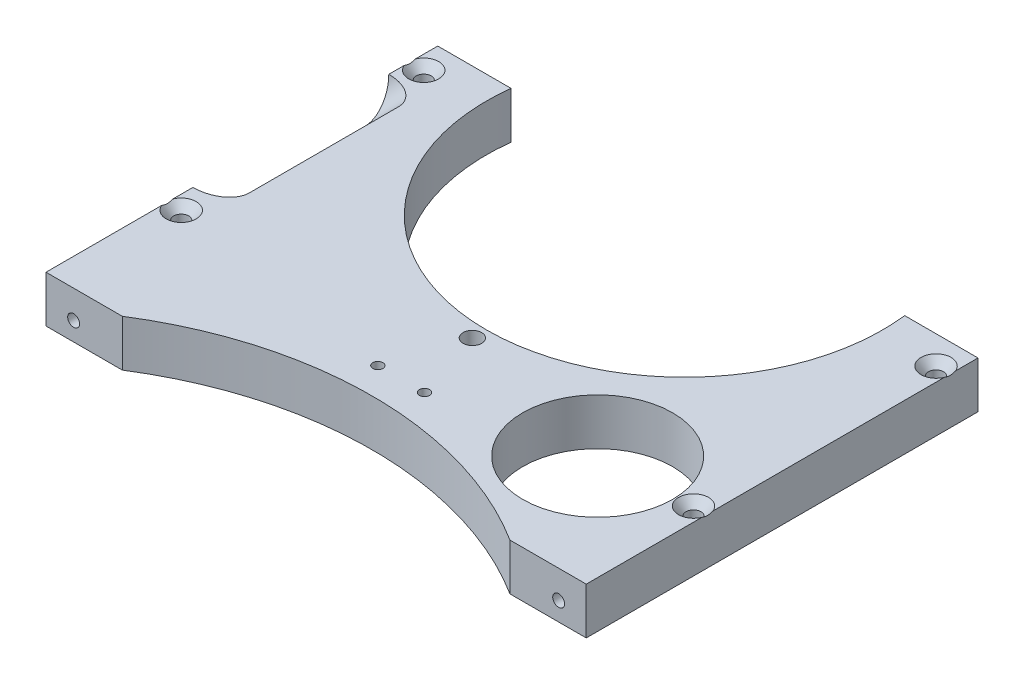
ISO-10303-21;
HEADER;
FILE_DESCRIPTION(('STEP AP214'),'2;1');
FILE_NAME('part.step','',(''),(''),'','','');
FILE_SCHEMA(('AUTOMOTIVE_DESIGN { 1 0 10303 214 1 1 1 1 }'));
ENDSEC;
DATA;
#1=APPLICATION_CONTEXT('core data for automotive mechanical design processes');
#2=APPLICATION_PROTOCOL_DEFINITION('international standard','automotive_design',2000,#1);
#3=PRODUCT_CONTEXT('',#1,'mechanical');
#4=PRODUCT('Part','Part','',(#3));
#5=PRODUCT_RELATED_PRODUCT_CATEGORY('part','',(#4));
#6=PRODUCT_DEFINITION_FORMATION('','',#4);
#7=PRODUCT_DEFINITION_CONTEXT('part definition',#1,'design');
#8=PRODUCT_DEFINITION('design','',#6,#7);
#9=PRODUCT_DEFINITION_SHAPE('','',#8);
#10=(LENGTH_UNIT() NAMED_UNIT(*) SI_UNIT(.MILLI.,.METRE.));
#11=(NAMED_UNIT(*) PLANE_ANGLE_UNIT() SI_UNIT($,.RADIAN.));
#12=(NAMED_UNIT(*) SI_UNIT($,.STERADIAN.) SOLID_ANGLE_UNIT());
#13=UNCERTAINTY_MEASURE_WITH_UNIT(LENGTH_MEASURE(1.E-05),#10,'distance_accuracy_value','');
#14=(GEOMETRIC_REPRESENTATION_CONTEXT(3) GLOBAL_UNCERTAINTY_ASSIGNED_CONTEXT((#13)) GLOBAL_UNIT_ASSIGNED_CONTEXT((#10,
#11,#12)) REPRESENTATION_CONTEXT('',''));
#15=CARTESIAN_POINT('',(0.,0.,0.));
#16=DIRECTION('',(0.,0.,1.));
#17=DIRECTION('',(1.,0.,0.));
#18=AXIS2_PLACEMENT_3D('',#15,#16,#17);
#19=CARTESIAN_POINT('',(-91.948,34.1376,-25.3999999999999));
#20=DIRECTION('',(-1.,0.,0.));
#21=DIRECTION('',(0.,0.,1.));
#22=AXIS2_PLACEMENT_3D('',#19,#20,#21);
#23=PLANE('',#22);
#24=CARTESIAN_POINT('',(-91.948,50.0126,-83.34375));
#25=DIRECTION('',(-1.,0.,0.));
#26=DIRECTION('',(0.,1.,0.));
#27=AXIS2_PLACEMENT_3D('',#24,#25,#26);
#28=ELLIPSE('',#27,11.2253201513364,7.93749999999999);
#29=CARTESIAN_POINT('',(-91.948,38.7872798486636,-83.34375));
#30=VERTEX_POINT('',#29);
#31=CARTESIAN_POINT('',(-91.948,50.0126,-75.40625));
#32=VERTEX_POINT('',#31);
#33=EDGE_CURVE('E200',#30,#32,#28,.T.);
#34=ORIENTED_EDGE('',*,*,#33,.F.);
#35=DIRECTION('',(0.,0.,1.));
#36=VECTOR('',#35,1.);
#37=CARTESIAN_POINT('',(-91.948,38.7872798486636,-25.3999999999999));
#38=LINE('',#37,#36);
#39=CARTESIAN_POINT('',(-91.948,38.7872798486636,-134.14375));
#40=VERTEX_POINT('',#39);
#41=EDGE_CURVE('E195',#40,#30,#38,.T.);
#42=ORIENTED_EDGE('',*,*,#41,.F.);
#43=CARTESIAN_POINT('',(-91.948,50.0126,-134.14375));
#44=DIRECTION('',(-1.,0.,0.));
#45=DIRECTION('',(0.,1.,0.));
#46=AXIS2_PLACEMENT_3D('',#43,#44,#45);
#47=ELLIPSE('',#46,11.2253201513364,7.93749999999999);
#48=CARTESIAN_POINT('',(-91.948,50.0126,-142.08125));
#49=VERTEX_POINT('',#48);
#50=EDGE_CURVE('E198',#49,#40,#47,.T.);
#51=ORIENTED_EDGE('',*,*,#50,.F.);
#52=DIRECTION('',(0.,0.,1.));
#53=VECTOR('',#52,1.);
#54=CARTESIAN_POINT('',(-91.948,50.0126,-25.3999999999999));
#55=LINE('',#54,#53);
#56=CARTESIAN_POINT('',(-91.948,50.0126,-147.349505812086));
#57=VERTEX_POINT('',#56);
#58=EDGE_CURVE('E288',#57,#49,#55,.T.);
#59=ORIENTED_EDGE('',*,*,#58,.F.);
#60=CARTESIAN_POINT('',(-91.948,56.0858646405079,-158.461342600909));
#61=CARTESIAN_POINT('',(-91.948,55.8940047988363,-158.273780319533));
#62=CARTESIAN_POINT('',(-91.948,55.7027207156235,-158.085624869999));
#63=CARTESIAN_POINT('',(-91.948,55.3215706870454,-157.707861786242));
#64=CARTESIAN_POINT('',(-91.948,55.1317048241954,-157.518254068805));
#65=CARTESIAN_POINT('',(-91.948,54.7532587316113,-157.136917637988));
#66=CARTESIAN_POINT('',(-91.948,54.5646823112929,-156.945185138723));
#67=CARTESIAN_POINT('',(-91.948,54.1896318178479,-156.559680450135));
#68=CARTESIAN_POINT('',(-91.948,54.0031576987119,-156.36590830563));
#69=CARTESIAN_POINT('',(-91.948,53.6229860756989,-155.96555114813));
#70=CARTESIAN_POINT('',(-91.948,53.4294299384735,-155.758831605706));
#71=CARTESIAN_POINT('',(-91.948,53.045996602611,-155.342010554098));
#72=CARTESIAN_POINT('',(-91.948,52.8561192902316,-155.131909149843));
#73=CARTESIAN_POINT('',(-91.948,52.4813312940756,-154.707663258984));
#74=CARTESIAN_POINT('',(-91.948,52.2964160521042,-154.49352281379));
#75=CARTESIAN_POINT('',(-91.948,51.9329898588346,-154.059894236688));
#76=CARTESIAN_POINT('',(-91.948,51.7544779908,-153.840406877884));
#77=CARTESIAN_POINT('',(-91.948,51.4175501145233,-153.409028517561));
#78=CARTESIAN_POINT('',(-91.948,51.2585821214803,-153.19757131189));
#79=CARTESIAN_POINT('',(-91.948,50.9511542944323,-152.7668217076));
#80=CARTESIAN_POINT('',(-91.948,50.8027023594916,-152.547523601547));
#81=CARTESIAN_POINT('',(-91.948,50.5227669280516,-152.102147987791));
#82=CARTESIAN_POINT('',(-91.948,50.3910909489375,-151.876192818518));
#83=CARTESIAN_POINT('',(-91.948,50.1493270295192,-151.4131299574));
#84=CARTESIAN_POINT('',(-91.948,50.0391996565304,-151.176043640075));
#85=CARTESIAN_POINT('',(-91.948,49.9080815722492,-150.839170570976));
#86=CARTESIAN_POINT('',(-91.948,49.8738866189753,-150.74448947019));
#87=CARTESIAN_POINT('',(-91.948,49.8106805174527,-150.553158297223));
#88=CARTESIAN_POINT('',(-91.948,49.7816814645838,-150.456504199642));
#89=CARTESIAN_POINT('',(-91.948,49.7233030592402,-150.237967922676));
#90=CARTESIAN_POINT('',(-91.948,49.6955344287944,-150.115648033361));
#91=CARTESIAN_POINT('',(-91.948,49.6502963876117,-149.869072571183));
#92=CARTESIAN_POINT('',(-91.948,49.6328289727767,-149.744816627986));
#93=CARTESIAN_POINT('',(-91.948,49.6090503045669,-149.495394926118));
#94=CARTESIAN_POINT('',(-91.948,49.6027240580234,-149.370230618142));
#95=CARTESIAN_POINT('',(-91.948,49.6015092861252,-149.119854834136));
#96=CARTESIAN_POINT('',(-91.948,49.6066198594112,-148.994643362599));
#97=CARTESIAN_POINT('',(-91.948,49.6277005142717,-148.748803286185));
#98=CARTESIAN_POINT('',(-91.948,49.6433522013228,-148.628146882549));
#99=CARTESIAN_POINT('',(-91.948,49.6844777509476,-148.388514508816));
#100=CARTESIAN_POINT('',(-91.948,49.7099536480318,-148.269538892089));
#101=CARTESIAN_POINT('',(-91.948,49.7697637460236,-148.033644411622));
#102=CARTESIAN_POINT('',(-91.948,49.8041129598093,-147.916729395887));
#103=CARTESIAN_POINT('',(-91.948,49.8805067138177,-147.685463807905));
#104=CARTESIAN_POINT('',(-91.948,49.9225514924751,-147.571113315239));
#105=CARTESIAN_POINT('',(-91.948,50.0228825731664,-147.320957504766));
#106=CARTESIAN_POINT('',(-91.948,50.0827203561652,-147.185777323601));
#107=CARTESIAN_POINT('',(-91.948,50.2102880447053,-146.919169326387));
#108=CARTESIAN_POINT('',(-91.948,50.2780211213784,-146.787743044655));
#109=CARTESIAN_POINT('',(-91.948,50.4199701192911,-146.528206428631));
#110=CARTESIAN_POINT('',(-91.948,50.4941956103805,-146.400101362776));
#111=CARTESIAN_POINT('',(-91.948,50.6478410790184,-146.147040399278));
#112=CARTESIAN_POINT('',(-91.948,50.7272617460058,-146.022084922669));
#113=CARTESIAN_POINT('',(-91.948,50.891554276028,-145.773122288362));
#114=CARTESIAN_POINT('',(-91.948,50.9764900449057,-145.649157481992));
#115=CARTESIAN_POINT('',(-91.948,51.1499317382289,-145.403755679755));
#116=CARTESIAN_POINT('',(-91.948,51.2384377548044,-145.282318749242));
#117=CARTESIAN_POINT('',(-91.948,51.4183105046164,-145.041775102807));
#118=CARTESIAN_POINT('',(-91.948,51.5096743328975,-144.922666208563));
#119=CARTESIAN_POINT('',(-91.948,51.6948541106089,-144.686382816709));
#120=CARTESIAN_POINT('',(-91.948,51.788669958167,-144.569208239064));
#121=CARTESIAN_POINT('',(-91.948,51.9932914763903,-144.318241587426));
#122=CARTESIAN_POINT('',(-91.948,52.1044477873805,-144.184735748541));
#123=CARTESIAN_POINT('',(-91.948,52.3290551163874,-143.919666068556));
#124=CARTESIAN_POINT('',(-91.948,52.4425062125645,-143.788102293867));
#125=CARTESIAN_POINT('',(-91.948,52.7857523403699,-143.395879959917));
#126=CARTESIAN_POINT('',(-91.948,53.0184104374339,-143.13772648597));
#127=CARTESIAN_POINT('',(-91.948,53.4893168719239,-142.626335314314));
#128=CARTESIAN_POINT('',(-91.948,53.7275682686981,-142.373100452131));
#129=CARTESIAN_POINT('',(-91.948,54.208160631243,-141.870533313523));
#130=CARTESIAN_POINT('',(-91.948,54.4505017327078,-141.62120116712));
#131=CARTESIAN_POINT('',(-91.948,54.9389487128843,-141.124954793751));
#132=CARTESIAN_POINT('',(-91.948,55.1850628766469,-140.878048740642));
#133=CARTESIAN_POINT('',(-91.948,55.6797453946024,-140.386703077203));
#134=CARTESIAN_POINT('',(-91.948,55.9283137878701,-140.142263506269));
#135=CARTESIAN_POINT('',(-91.948,56.4273140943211,-139.655472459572));
#136=CARTESIAN_POINT('',(-91.948,56.6777453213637,-139.413120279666));
#137=CARTESIAN_POINT('',(-91.948,57.1801894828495,-138.930061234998));
#138=CARTESIAN_POINT('',(-91.948,57.4322024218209,-138.689354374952));
#139=CARTESIAN_POINT('',(-91.948,58.1278633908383,-138.028475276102));
#140=CARTESIAN_POINT('',(-91.948,58.5728517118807,-137.609714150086));
#141=CARTESIAN_POINT('',(-91.948,59.4657595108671,-136.775244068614));
#142=CARTESIAN_POINT('',(-91.948,59.9136792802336,-136.359535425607));
#143=CARTESIAN_POINT('',(-91.948,60.8094635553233,-135.53252731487));
#144=CARTESIAN_POINT('',(-91.948,61.2573173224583,-135.121216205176));
#145=CARTESIAN_POINT('',(-91.948,62.154658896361,-134.300489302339));
#146=CARTESIAN_POINT('',(-91.948,62.6041464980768,-133.891073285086));
#147=CARTESIAN_POINT('',(-91.948,63.0542476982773,-133.48233737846));
#148=B_SPLINE_CURVE_WITH_KNOTS('',3,(#60,#61,#62,#63,#64,#65,#66,#67,#68,#69,#70,#71,#72,#73,
#74,#75,#76,#77,#78,#79,#80,#81,#82,#83,#84,#85,#86,#87,#88,#89,#90,#91,#92,#93,#94,#95,#96,#97,
#98,#99,#100,#101,#102,#103,#104,#105,#106,#107,#108,#109,#110,#111,#112,#113,#114,#115,#116,
#117,#118,#119,#120,#121,#122,#123,#124,#125,#126,#127,#128,#129,#130,#131,#132,#133,#134,#135,
#136,#137,#138,#139,#140,#141,#142,#143,#144,#145,#146,#147),.UNSPECIFIED.,.F.,.F.,(4,2,2,2,2,2,
2,2,2,2,2,2,2,2,2,2,2,2,2,2,2,2,2,2,2,2,2,2,2,2,2,2,2,2,2,2,2,2,2,2,2,2,2,4),(0.,
0.804930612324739,1.60990769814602,2.4166792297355,3.22343307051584,4.07297059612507,
4.92248181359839,5.77118391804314,6.61976402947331,7.41317731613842,8.20718038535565,
8.9910437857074,9.7734590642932,10.0753341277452,10.3779030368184,10.7537922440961,
11.1297542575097,11.5052099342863,11.8806360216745,12.2452026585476,12.6098448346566,
12.9751080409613,13.3403825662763,13.7835548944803,14.2269058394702,14.6709216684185,
15.1149965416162,15.5657336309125,16.0164823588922,16.4667869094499,16.9170727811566,
17.438208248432,17.9593614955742,19.0018083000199,20.0448392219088,21.0879048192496,
22.1337388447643,23.1795895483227,24.2250724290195,25.2705583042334,27.1036694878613,
28.9369657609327,30.7611717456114,32.585156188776),.UNSPECIFIED.);
#149=CARTESIAN_POINT('',(-91.948,50.0126,-151.100494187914));
#150=VERTEX_POINT('',#149);
#151=EDGE_CURVE('E399',#150,#57,#148,.T.);
#152=ORIENTED_EDGE('',*,*,#151,.F.);
#153=CARTESIAN_POINT('',(-91.948,50.0126,-158.75));
#154=VERTEX_POINT('',#153);
#155=EDGE_CURVE('E284',#154,#150,#55,.T.);
#156=ORIENTED_EDGE('',*,*,#155,.F.);
#157=DIRECTION('',(0.,1.,0.));
#158=VECTOR('',#157,1.);
#159=CARTESIAN_POINT('',(-91.948,34.1376,-158.75));
#160=LINE('',#159,#158);
#161=CARTESIAN_POINT('',(-91.948,34.1376,-158.75));
#162=VERTEX_POINT('',#161);
#163=EDGE_CURVE('E311',#162,#154,#160,.T.);
#164=ORIENTED_EDGE('',*,*,#163,.F.);
#165=DIRECTION('',(0.,0.,1.));
#166=VECTOR('',#165,1.);
#167=CARTESIAN_POINT('',(-91.948,34.1376,-25.3999999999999));
#168=LINE('',#167,#166);
#169=CARTESIAN_POINT('',(-91.948,34.1376,-25.3999999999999));
#170=VERTEX_POINT('',#169);
#171=EDGE_CURVE('E256',#162,#170,#168,.T.);
#172=ORIENTED_EDGE('',*,*,#171,.T.);
#173=DIRECTION('',(0.,1.,0.));
#174=VECTOR('',#173,1.);
#175=CARTESIAN_POINT('',(-91.948,34.1376,-25.3999999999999));
#176=LINE('',#175,#174);
#177=CARTESIAN_POINT('',(-91.948,50.0126,-25.3999999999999));
#178=VERTEX_POINT('',#177);
#179=EDGE_CURVE('E283',#170,#178,#176,.T.);
#180=ORIENTED_EDGE('',*,*,#179,.T.);
#181=CARTESIAN_POINT('',(-91.948,50.0126,-64.7995058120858));
#182=VERTEX_POINT('',#181);
#183=EDGE_CURVE('E255',#182,#178,#55,.T.);
#184=ORIENTED_EDGE('',*,*,#183,.F.);
#185=CARTESIAN_POINT('',(-91.948,56.0858646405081,-75.9113426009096));
#186=CARTESIAN_POINT('',(-91.948,55.8940047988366,-75.7237803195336));
#187=CARTESIAN_POINT('',(-91.948,55.7027207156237,-75.5356248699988));
#188=CARTESIAN_POINT('',(-91.948,55.3215706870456,-75.1578617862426));
#189=CARTESIAN_POINT('',(-91.948,55.1317048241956,-74.9682540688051));
#190=CARTESIAN_POINT('',(-91.948,54.7532587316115,-74.5869176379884));
#191=CARTESIAN_POINT('',(-91.948,54.5646823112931,-74.3951851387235));
#192=CARTESIAN_POINT('',(-91.948,54.1896318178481,-74.0096804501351));
#193=CARTESIAN_POINT('',(-91.948,54.0031576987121,-73.81590830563));
#194=CARTESIAN_POINT('',(-91.948,53.622986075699,-73.4155511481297));
#195=CARTESIAN_POINT('',(-91.948,53.4294299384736,-73.2088316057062));
#196=CARTESIAN_POINT('',(-91.948,53.0459966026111,-72.792010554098));
#197=CARTESIAN_POINT('',(-91.948,52.8561192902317,-72.5819091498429));
#198=CARTESIAN_POINT('',(-91.948,52.4813312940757,-72.1576632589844));
#199=CARTESIAN_POINT('',(-91.948,52.2964160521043,-71.9435228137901));
#200=CARTESIAN_POINT('',(-91.948,51.9329898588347,-71.5098942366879));
#201=CARTESIAN_POINT('',(-91.948,51.7544779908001,-71.2904068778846));
#202=CARTESIAN_POINT('',(-91.948,51.4175501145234,-70.859028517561));
#203=CARTESIAN_POINT('',(-91.948,51.2585821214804,-70.6475713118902));
#204=CARTESIAN_POINT('',(-91.948,50.9511542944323,-70.2168217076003));
#205=CARTESIAN_POINT('',(-91.948,50.8027023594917,-69.9975236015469));
#206=CARTESIAN_POINT('',(-91.948,50.5227669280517,-69.5521479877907));
#207=CARTESIAN_POINT('',(-91.948,50.3910909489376,-69.3261928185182));
#208=CARTESIAN_POINT('',(-91.948,50.1493270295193,-68.8631299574));
#209=CARTESIAN_POINT('',(-91.948,50.0391996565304,-68.6260436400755));
#210=CARTESIAN_POINT('',(-91.948,49.9080815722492,-68.2891705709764));
#211=CARTESIAN_POINT('',(-91.948,49.8738866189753,-68.1944894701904));
#212=CARTESIAN_POINT('',(-91.948,49.8106805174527,-68.0031582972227));
#213=CARTESIAN_POINT('',(-91.948,49.7816814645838,-67.9065041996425));
#214=CARTESIAN_POINT('',(-91.948,49.7233030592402,-67.6879679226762));
#215=CARTESIAN_POINT('',(-91.948,49.6955344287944,-67.5656480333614));
#216=CARTESIAN_POINT('',(-91.948,49.6502963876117,-67.3190725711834));
#217=CARTESIAN_POINT('',(-91.948,49.6328289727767,-67.1948166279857));
#218=CARTESIAN_POINT('',(-91.948,49.6090503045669,-66.9453949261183));
#219=CARTESIAN_POINT('',(-91.948,49.6027240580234,-66.8202306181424));
#220=CARTESIAN_POINT('',(-91.948,49.6015092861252,-66.5698548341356));
#221=CARTESIAN_POINT('',(-91.948,49.6066198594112,-66.4446433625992));
#222=CARTESIAN_POINT('',(-91.948,49.6277005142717,-66.1988032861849));
#223=CARTESIAN_POINT('',(-91.948,49.6433522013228,-66.0781468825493));
#224=CARTESIAN_POINT('',(-91.948,49.6844777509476,-65.8385145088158));
#225=CARTESIAN_POINT('',(-91.948,49.7099536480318,-65.7195388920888));
#226=CARTESIAN_POINT('',(-91.948,49.7697637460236,-65.4836444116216));
#227=CARTESIAN_POINT('',(-91.948,49.8041129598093,-65.366729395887));
#228=CARTESIAN_POINT('',(-91.948,49.8805067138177,-65.1354638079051));
#229=CARTESIAN_POINT('',(-91.948,49.9225514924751,-65.0211133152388));
#230=CARTESIAN_POINT('',(-91.948,50.0228825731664,-64.770957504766));
#231=CARTESIAN_POINT('',(-91.948,50.0827203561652,-64.635777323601));
#232=CARTESIAN_POINT('',(-91.948,50.2102880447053,-64.3691693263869));
#233=CARTESIAN_POINT('',(-91.948,50.2780211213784,-64.237743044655));
#234=CARTESIAN_POINT('',(-91.948,50.4199701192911,-63.9782064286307));
#235=CARTESIAN_POINT('',(-91.948,50.4941956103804,-63.8501013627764));
#236=CARTESIAN_POINT('',(-91.948,50.6478410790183,-63.5970403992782));
#237=CARTESIAN_POINT('',(-91.948,50.7272617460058,-63.4720849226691));
#238=CARTESIAN_POINT('',(-91.948,50.891554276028,-63.2231222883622));
#239=CARTESIAN_POINT('',(-91.948,50.9764900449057,-63.0991574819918));
#240=CARTESIAN_POINT('',(-91.948,51.1499317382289,-62.8537556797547));
#241=CARTESIAN_POINT('',(-91.948,51.2384377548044,-62.7323187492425));
#242=CARTESIAN_POINT('',(-91.948,51.4183105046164,-62.4917751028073));
#243=CARTESIAN_POINT('',(-91.948,51.5096743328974,-62.3726662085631));
#244=CARTESIAN_POINT('',(-91.948,51.6948541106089,-62.1363828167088));
#245=CARTESIAN_POINT('',(-91.948,51.7886699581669,-62.0192082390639));
#246=CARTESIAN_POINT('',(-91.948,51.9932914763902,-61.7682415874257));
#247=CARTESIAN_POINT('',(-91.948,52.1044477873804,-61.634735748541));
#248=CARTESIAN_POINT('',(-91.948,52.3290551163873,-61.3696660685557));
#249=CARTESIAN_POINT('',(-91.948,52.4425062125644,-61.2381022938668));
#250=CARTESIAN_POINT('',(-91.948,52.7857523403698,-60.8458799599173));
#251=CARTESIAN_POINT('',(-91.948,53.0184104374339,-60.5877264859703));
#252=CARTESIAN_POINT('',(-91.948,53.4893168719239,-60.0763353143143));
#253=CARTESIAN_POINT('',(-91.948,53.727568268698,-59.8231004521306));
#254=CARTESIAN_POINT('',(-91.948,54.208160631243,-59.3205333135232));
#255=CARTESIAN_POINT('',(-91.948,54.4505017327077,-59.0712011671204));
#256=CARTESIAN_POINT('',(-91.948,54.9389487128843,-58.5749547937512));
#257=CARTESIAN_POINT('',(-91.948,55.1850628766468,-58.3280487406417));
#258=CARTESIAN_POINT('',(-91.948,55.6797453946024,-57.8367030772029));
#259=CARTESIAN_POINT('',(-91.948,55.9283137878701,-57.5922635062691));
#260=CARTESIAN_POINT('',(-91.948,56.427314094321,-57.1054724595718));
#261=CARTESIAN_POINT('',(-91.948,56.6777453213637,-56.8631202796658));
#262=CARTESIAN_POINT('',(-91.948,57.1801894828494,-56.3800612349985));
#263=CARTESIAN_POINT('',(-91.948,57.4322024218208,-56.1393543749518));
#264=CARTESIAN_POINT('',(-91.948,58.1278633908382,-55.4784752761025));
#265=CARTESIAN_POINT('',(-91.948,58.5728517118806,-55.0597141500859));
#266=CARTESIAN_POINT('',(-91.948,59.465759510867,-54.2252440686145));
#267=CARTESIAN_POINT('',(-91.948,59.9136792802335,-53.8095354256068));
#268=CARTESIAN_POINT('',(-91.948,60.8094635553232,-52.9825273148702));
#269=CARTESIAN_POINT('',(-91.948,61.2573173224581,-52.5712162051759));
#270=CARTESIAN_POINT('',(-91.948,62.1546588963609,-51.7504893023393));
#271=CARTESIAN_POINT('',(-91.948,62.6041464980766,-51.3410732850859));
#272=CARTESIAN_POINT('',(-91.948,63.0542476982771,-50.9323373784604));
#273=B_SPLINE_CURVE_WITH_KNOTS('',3,(#185,#186,#187,#188,#189,#190,#191,#192,#193,#194,#195,
#196,#197,#198,#199,#200,#201,#202,#203,#204,#205,#206,#207,#208,#209,#210,#211,#212,#213,#214,
#215,#216,#217,#218,#219,#220,#221,#222,#223,#224,#225,#226,#227,#228,#229,#230,#231,#232,#233,
#234,#235,#236,#237,#238,#239,#240,#241,#242,#243,#244,#245,#246,#247,#248,#249,#250,#251,#252,
#253,#254,#255,#256,#257,#258,#259,#260,#261,#262,#263,#264,#265,#266,#267,#268,#269,#270,#271,
#272),.UNSPECIFIED.,.F.,.F.,(4,2,2,2,2,2,2,2,2,2,2,2,2,2,2,2,2,2,2,2,2,2,2,2,2,2,2,2,2,2,2,2,2,
2,2,2,2,2,2,2,2,2,2,4),(0.,0.804930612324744,1.60990769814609,2.4166792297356,3.22343307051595,
4.07297059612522,4.92248181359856,5.77118391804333,6.61976402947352,7.41317731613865,
8.20718038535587,8.99104378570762,9.77345906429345,10.0753341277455,10.3779030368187,
10.7537922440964,11.12975425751,11.5052099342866,11.8806360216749,12.245202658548,
12.609844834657,12.9751080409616,13.3403825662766,13.7835548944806,14.2269058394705,
14.6709216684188,15.1149965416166,15.5657336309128,16.0164823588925,16.4667869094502,
16.9170727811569,17.4382082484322,17.9593614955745,19.0018083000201,20.0448392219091,
21.0879048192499,22.1337388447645,23.1795895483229,24.2250724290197,25.2705583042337,
27.1036694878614,28.9369657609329,30.7611717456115,32.5851561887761),.UNSPECIFIED.);
#274=CARTESIAN_POINT('',(-91.948,50.0126,-68.5504941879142));
#275=VERTEX_POINT('',#274);
#276=EDGE_CURVE('E397',#275,#182,#273,.T.);
#277=ORIENTED_EDGE('',*,*,#276,.F.);
#278=EDGE_CURVE('E64',#32,#275,#55,.T.);
#279=ORIENTED_EDGE('',*,*,#278,.F.);
#280=EDGE_LOOP('',(#34,#42,#51,#59,#152,#156,#164,#172,#180,#184,#277,#279));
#281=FACE_BOUND('',#280,.T.);
#282=ADVANCED_FACE('F42',(#281),#23,.T.);
#283=CARTESIAN_POINT('',(-91.948,34.1376,-158.75));
#284=DIRECTION('',(0.,0.,-1.));
#285=DIRECTION('',(-1.,0.,0.));
#286=AXIS2_PLACEMENT_3D('',#283,#284,#285);
#287=PLANE('',#286);
#288=CARTESIAN_POINT('',(-76.2,42.0751,-158.75));
#289=DIRECTION('',(0.,0.,-1.));
#290=DIRECTION('',(-1.,0.,0.));
#291=AXIS2_PLACEMENT_3D('',#288,#289,#290);
#292=CIRCLE('',#291,2.0193);
#293=CARTESIAN_POINT('',(-78.2193,42.0751,-158.75));
#294=VERTEX_POINT('',#293);
#295=EDGE_CURVE('E177',#294,#294,#292,.T.);
#296=ORIENTED_EDGE('',*,*,#295,.F.);
#297=EDGE_LOOP('',(#296));
#298=FACE_BOUND('',#297,.T.);
#299=DIRECTION('',(-1.,0.,0.));
#300=VECTOR('',#299,1.);
#301=CARTESIAN_POINT('',(-91.948,50.0126,-158.75));
#302=LINE('',#301,#300);
#303=CARTESIAN_POINT('',(-66.9938169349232,50.0126,-158.75));
#304=VERTEX_POINT('',#303);
#305=EDGE_CURVE('E260',#304,#154,#302,.T.);
#306=ORIENTED_EDGE('',*,*,#305,.F.);
#307=DIRECTION('',(0.,1.,0.));
#308=VECTOR('',#307,1.);
#309=CARTESIAN_POINT('',(-66.9938169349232,34.1376,-158.75));
#310=LINE('',#309,#308);
#311=CARTESIAN_POINT('',(-66.9938169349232,34.1376,-158.75));
#312=VERTEX_POINT('',#311);
#313=EDGE_CURVE('E314',#312,#304,#310,.T.);
#314=ORIENTED_EDGE('',*,*,#313,.F.);
#315=DIRECTION('',(-1.,0.,0.));
#316=VECTOR('',#315,1.);
#317=CARTESIAN_POINT('',(-91.948,34.1376,-158.75));
#318=LINE('',#317,#316);
#319=EDGE_CURVE('E280',#312,#162,#318,.T.);
#320=ORIENTED_EDGE('',*,*,#319,.T.);
#321=ORIENTED_EDGE('',*,*,#163,.T.);
#322=EDGE_LOOP('',(#306,#314,#320,#321));
#323=FACE_BOUND('',#322,.T.);
#324=ADVANCED_FACE('F377',(#298,#323),#287,.T.);
#325=CARTESIAN_POINT('',(0.,34.1376,-150.8125));
#326=DIRECTION('',(0.,1.,0.));
#327=DIRECTION('',(0.,0.,1.));
#328=AXIS2_PLACEMENT_3D('',#325,#326,#327);
#329=CYLINDRICAL_SURFACE('',#328,67.4624);
#330=CARTESIAN_POINT('',(0.,50.0126,-150.8125));
#331=DIRECTION('',(0.,-1.,0.));
#332=DIRECTION('',(0.,0.,1.));
#333=AXIS2_PLACEMENT_3D('',#330,#331,#332);
#334=CIRCLE('',#333,67.4624);
#335=CARTESIAN_POINT('',(66.9938169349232,50.0126,-158.75));
#336=VERTEX_POINT('',#335);
#337=EDGE_CURVE('E305',#336,#304,#334,.T.);
#338=ORIENTED_EDGE('',*,*,#337,.F.);
#339=DIRECTION('',(0.,1.,0.));
#340=VECTOR('',#339,1.);
#341=CARTESIAN_POINT('',(66.9938169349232,34.1376,-158.75));
#342=LINE('',#341,#340);
#343=CARTESIAN_POINT('',(66.9938169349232,34.1376,-158.75));
#344=VERTEX_POINT('',#343);
#345=EDGE_CURVE('E316',#344,#336,#342,.T.);
#346=ORIENTED_EDGE('',*,*,#345,.F.);
#347=CARTESIAN_POINT('',(0.,34.1376,-150.8125));
#348=DIRECTION('',(0.,-1.,0.));
#349=DIRECTION('',(0.,0.,1.));
#350=AXIS2_PLACEMENT_3D('',#347,#348,#349);
#351=CIRCLE('',#350,67.4624);
#352=EDGE_CURVE('E276',#344,#312,#351,.T.);
#353=ORIENTED_EDGE('',*,*,#352,.T.);
#354=ORIENTED_EDGE('',*,*,#313,.T.);
#355=EDGE_LOOP('',(#338,#346,#353,#354));
#356=FACE_BOUND('',#355,.T.);
#357=ADVANCED_FACE('F382',(#356),#329,.F.);
#358=CARTESIAN_POINT('',(91.948,34.1376,-158.75));
#359=DIRECTION('',(0.,0.,-1.));
#360=DIRECTION('',(-1.,0.,0.));
#361=AXIS2_PLACEMENT_3D('',#358,#359,#360);
#362=PLANE('',#361);
#363=CARTESIAN_POINT('',(76.2,42.0751,-158.75));
#364=DIRECTION('',(0.,0.,-1.));
#365=DIRECTION('',(-1.,0.,0.));
#366=AXIS2_PLACEMENT_3D('',#363,#364,#365);
#367=CIRCLE('',#366,2.0193);
#368=CARTESIAN_POINT('',(74.1807,42.0751,-158.75));
#369=VERTEX_POINT('',#368);
#370=EDGE_CURVE('E178',#369,#369,#367,.T.);
#371=ORIENTED_EDGE('',*,*,#370,.F.);
#372=EDGE_LOOP('',(#371));
#373=FACE_BOUND('',#372,.T.);
#374=DIRECTION('',(-1.,0.,0.));
#375=VECTOR('',#374,1.);
#376=CARTESIAN_POINT('',(91.948,50.0126,-158.75));
#377=LINE('',#376,#375);
#378=CARTESIAN_POINT('',(91.948,50.0126,-158.75));
#379=VERTEX_POINT('',#378);
#380=EDGE_CURVE('E301',#379,#336,#377,.T.);
#381=ORIENTED_EDGE('',*,*,#380,.F.);
#382=DIRECTION('',(0.,1.,0.));
#383=VECTOR('',#382,1.);
#384=CARTESIAN_POINT('',(91.948,34.1376,-158.75));
#385=LINE('',#384,#383);
#386=CARTESIAN_POINT('',(91.948,34.1376,-158.75));
#387=VERTEX_POINT('',#386);
#388=EDGE_CURVE('E319',#387,#379,#385,.T.);
#389=ORIENTED_EDGE('',*,*,#388,.F.);
#390=DIRECTION('',(-1.,0.,0.));
#391=VECTOR('',#390,1.);
#392=CARTESIAN_POINT('',(91.948,34.1376,-158.75));
#393=LINE('',#392,#391);
#394=EDGE_CURVE('E272',#387,#344,#393,.T.);
#395=ORIENTED_EDGE('',*,*,#394,.T.);
#396=ORIENTED_EDGE('',*,*,#345,.T.);
#397=EDGE_LOOP('',(#381,#389,#395,#396));
#398=FACE_BOUND('',#397,.T.);
#399=ADVANCED_FACE('F354',(#373,#398),#362,.T.);
#400=CARTESIAN_POINT('',(91.948,34.1376,-25.4));
#401=DIRECTION('',(1.,0.,0.));
#402=DIRECTION('',(0.,0.,-1.));
#403=AXIS2_PLACEMENT_3D('',#400,#401,#402);
#404=PLANE('',#403);
#405=CARTESIAN_POINT('',(91.948,56.085864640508,-75.9113426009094));
#406=CARTESIAN_POINT('',(91.948,55.8940047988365,-75.7237803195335));
#407=CARTESIAN_POINT('',(91.948,55.7027207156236,-75.5356248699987));
#408=CARTESIAN_POINT('',(91.948,55.3215706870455,-75.1578617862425));
#409=CARTESIAN_POINT('',(91.948,55.1317048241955,-74.968254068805));
#410=CARTESIAN_POINT('',(91.948,54.7532587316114,-74.5869176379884));
#411=CARTESIAN_POINT('',(91.948,54.564682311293,-74.3951851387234));
#412=CARTESIAN_POINT('',(91.948,54.189631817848,-74.0096804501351));
#413=CARTESIAN_POINT('',(91.948,54.003157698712,-73.8159083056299));
#414=CARTESIAN_POINT('',(91.948,53.6229860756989,-73.4155511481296));
#415=CARTESIAN_POINT('',(91.948,53.4294299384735,-73.2088316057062));
#416=CARTESIAN_POINT('',(91.948,53.045996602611,-72.792010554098));
#417=CARTESIAN_POINT('',(91.948,52.8561192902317,-72.5819091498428));
#418=CARTESIAN_POINT('',(91.948,52.4813312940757,-72.1576632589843));
#419=CARTESIAN_POINT('',(91.948,52.2964160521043,-71.94352281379));
#420=CARTESIAN_POINT('',(91.948,51.9329898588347,-71.5098942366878));
#421=CARTESIAN_POINT('',(91.948,51.7544779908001,-71.2904068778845));
#422=CARTESIAN_POINT('',(91.948,51.4175501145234,-70.859028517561));
#423=CARTESIAN_POINT('',(91.948,51.2585821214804,-70.6475713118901));
#424=CARTESIAN_POINT('',(91.948,50.9511542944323,-70.2168217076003));
#425=CARTESIAN_POINT('',(91.948,50.8027023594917,-69.9975236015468));
#426=CARTESIAN_POINT('',(91.948,50.5227669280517,-69.5521479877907));
#427=CARTESIAN_POINT('',(91.948,50.3910909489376,-69.3261928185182));
#428=CARTESIAN_POINT('',(91.948,50.1493270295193,-68.8631299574));
#429=CARTESIAN_POINT('',(91.948,50.0391996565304,-68.6260436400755));
#430=CARTESIAN_POINT('',(91.948,49.9080815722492,-68.2891705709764));
#431=CARTESIAN_POINT('',(91.948,49.8738866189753,-68.1944894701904));
#432=CARTESIAN_POINT('',(91.948,49.8106805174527,-68.0031582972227));
#433=CARTESIAN_POINT('',(91.948,49.7816814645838,-67.9065041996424));
#434=CARTESIAN_POINT('',(91.948,49.7233030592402,-67.6879679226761));
#435=CARTESIAN_POINT('',(91.948,49.6955344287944,-67.5656480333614));
#436=CARTESIAN_POINT('',(91.948,49.6502963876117,-67.3190725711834));
#437=CARTESIAN_POINT('',(91.948,49.6328289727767,-67.1948166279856));
#438=CARTESIAN_POINT('',(91.948,49.6090503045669,-66.9453949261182));
#439=CARTESIAN_POINT('',(91.948,49.6027240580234,-66.8202306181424));
#440=CARTESIAN_POINT('',(91.948,49.6015092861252,-66.5698548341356));
#441=CARTESIAN_POINT('',(91.948,49.6066198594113,-66.4446433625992));
#442=CARTESIAN_POINT('',(91.948,49.6277005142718,-66.1988032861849));
#443=CARTESIAN_POINT('',(91.948,49.6433522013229,-66.0781468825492));
#444=CARTESIAN_POINT('',(91.948,49.6844777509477,-65.8385145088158));
#445=CARTESIAN_POINT('',(91.948,49.7099536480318,-65.7195388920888));
#446=CARTESIAN_POINT('',(91.948,49.7697637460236,-65.4836444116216));
#447=CARTESIAN_POINT('',(91.948,49.8041129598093,-65.366729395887));
#448=CARTESIAN_POINT('',(91.948,49.8805067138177,-65.1354638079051));
#449=CARTESIAN_POINT('',(91.948,49.9225514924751,-65.0211133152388));
#450=CARTESIAN_POINT('',(91.948,50.0228825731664,-64.770957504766));
#451=CARTESIAN_POINT('',(91.948,50.0827203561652,-64.635777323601));
#452=CARTESIAN_POINT('',(91.948,50.2102880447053,-64.3691693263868));
#453=CARTESIAN_POINT('',(91.948,50.2780211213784,-64.237743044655));
#454=CARTESIAN_POINT('',(91.948,50.4199701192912,-63.9782064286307));
#455=CARTESIAN_POINT('',(91.948,50.4941956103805,-63.8501013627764));
#456=CARTESIAN_POINT('',(91.948,50.6478410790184,-63.5970403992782));
#457=CARTESIAN_POINT('',(91.948,50.7272617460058,-63.4720849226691));
#458=CARTESIAN_POINT('',(91.948,50.8915542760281,-63.2231222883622));
#459=CARTESIAN_POINT('',(91.948,50.9764900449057,-63.0991574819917));
#460=CARTESIAN_POINT('',(91.948,51.1499317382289,-62.8537556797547));
#461=CARTESIAN_POINT('',(91.948,51.2384377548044,-62.7323187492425));
#462=CARTESIAN_POINT('',(91.948,51.4183105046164,-62.4917751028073));
#463=CARTESIAN_POINT('',(91.948,51.5096743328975,-62.3726662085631));
#464=CARTESIAN_POINT('',(91.948,51.694854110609,-62.1363828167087));
#465=CARTESIAN_POINT('',(91.948,51.788669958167,-62.0192082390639));
#466=CARTESIAN_POINT('',(91.948,51.9932914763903,-61.7682415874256));
#467=CARTESIAN_POINT('',(91.948,52.1044477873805,-61.6347357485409));
#468=CARTESIAN_POINT('',(91.948,52.3290551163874,-61.3696660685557));
#469=CARTESIAN_POINT('',(91.948,52.4425062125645,-61.2381022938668));
#470=CARTESIAN_POINT('',(91.948,52.7857523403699,-60.8458799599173));
#471=CARTESIAN_POINT('',(91.948,53.0184104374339,-60.5877264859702));
#472=CARTESIAN_POINT('',(91.948,53.4893168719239,-60.0763353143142));
#473=CARTESIAN_POINT('',(91.948,53.7275682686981,-59.8231004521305));
#474=CARTESIAN_POINT('',(91.948,54.208160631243,-59.3205333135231));
#475=CARTESIAN_POINT('',(91.948,54.4505017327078,-59.0712011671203));
#476=CARTESIAN_POINT('',(91.948,54.9389487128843,-58.5749547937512));
#477=CARTESIAN_POINT('',(91.948,55.1850628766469,-58.3280487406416));
#478=CARTESIAN_POINT('',(91.948,55.6797453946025,-57.8367030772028));
#479=CARTESIAN_POINT('',(91.948,55.9283137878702,-57.592263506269));
#480=CARTESIAN_POINT('',(91.948,56.4273140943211,-57.1054724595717));
#481=CARTESIAN_POINT('',(91.948,56.6777453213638,-56.8631202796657));
#482=CARTESIAN_POINT('',(91.948,57.1801894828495,-56.3800612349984));
#483=CARTESIAN_POINT('',(91.948,57.4322024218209,-56.1393543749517));
#484=CARTESIAN_POINT('',(91.948,58.1278633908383,-55.4784752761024));
#485=CARTESIAN_POINT('',(91.948,58.5728517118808,-55.0597141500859));
#486=CARTESIAN_POINT('',(91.948,59.4657595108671,-54.2252440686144));
#487=CARTESIAN_POINT('',(91.948,59.9136792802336,-53.8095354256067));
#488=CARTESIAN_POINT('',(91.948,60.8094635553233,-52.98252731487));
#489=CARTESIAN_POINT('',(91.948,61.2573173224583,-52.5712162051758));
#490=CARTESIAN_POINT('',(91.948,62.154658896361,-51.7504893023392));
#491=CARTESIAN_POINT('',(91.948,62.6041464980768,-51.3410732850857));
#492=CARTESIAN_POINT('',(91.948,63.0542476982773,-50.9323373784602));
#493=B_SPLINE_CURVE_WITH_KNOTS('',3,(#405,#406,#407,#408,#409,#410,#411,#412,#413,#414,#415,
#416,#417,#418,#419,#420,#421,#422,#423,#424,#425,#426,#427,#428,#429,#430,#431,#432,#433,#434,
#435,#436,#437,#438,#439,#440,#441,#442,#443,#444,#445,#446,#447,#448,#449,#450,#451,#452,#453,
#454,#455,#456,#457,#458,#459,#460,#461,#462,#463,#464,#465,#466,#467,#468,#469,#470,#471,#472,
#473,#474,#475,#476,#477,#478,#479,#480,#481,#482,#483,#484,#485,#486,#487,#488,#489,#490,#491,
#492),.UNSPECIFIED.,.F.,.F.,(4,2,2,2,2,2,2,2,2,2,2,2,2,2,2,2,2,2,2,2,2,2,2,2,2,2,2,2,2,2,2,2,2,
2,2,2,2,2,2,2,2,2,2,4),(0.,0.804930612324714,1.60990769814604,2.41667922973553,3.22343307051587,
4.07297059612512,4.92248181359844,5.77118391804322,6.61976402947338,7.41317731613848,
8.20718038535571,8.99104378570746,9.77345906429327,10.0753341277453,10.3779030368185,
10.7537922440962,11.1297542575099,11.5052099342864,11.8806360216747,12.2452026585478,
12.6098448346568,12.9751080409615,13.3403825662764,13.7835548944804,14.2269058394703,
14.6709216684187,15.1149965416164,15.5657336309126,16.0164823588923,16.46678690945,
16.9170727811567,17.4382082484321,17.9593614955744,19.00180830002,20.044839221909,
21.0879048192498,22.1337388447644,23.1795895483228,24.2250724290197,25.2705583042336,
27.1036694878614,28.9369657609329,30.7611717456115,32.5851561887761),.UNSPECIFIED.);
#494=CARTESIAN_POINT('',(91.948,50.0126,-64.7995058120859));
#495=VERTEX_POINT('',#494);
#496=CARTESIAN_POINT('',(91.948,50.0126,-68.5504941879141));
#497=VERTEX_POINT('',#496);
#498=EDGE_CURVE('E338',#495,#497,#493,.F.);
#499=ORIENTED_EDGE('',*,*,#498,.F.);
#500=DIRECTION('',(0.,0.,-1.));
#501=VECTOR('',#500,1.);
#502=CARTESIAN_POINT('',(91.948,50.0126,-25.4));
#503=LINE('',#502,#501);
#504=CARTESIAN_POINT('',(91.948,50.0126,-25.4));
#505=VERTEX_POINT('',#504);
#506=EDGE_CURVE('E298',#505,#495,#503,.T.);
#507=ORIENTED_EDGE('',*,*,#506,.F.);
#508=DIRECTION('',(0.,1.,0.));
#509=VECTOR('',#508,1.);
#510=CARTESIAN_POINT('',(91.948,34.1376,-25.4));
#511=LINE('',#510,#509);
#512=CARTESIAN_POINT('',(91.948,34.1376,-25.4));
#513=VERTEX_POINT('',#512);
#514=EDGE_CURVE('E323',#513,#505,#511,.T.);
#515=ORIENTED_EDGE('',*,*,#514,.F.);
#516=DIRECTION('',(0.,0.,-1.));
#517=VECTOR('',#516,1.);
#518=CARTESIAN_POINT('',(91.948,34.1376,-25.4));
#519=LINE('',#518,#517);
#520=EDGE_CURVE('E269',#513,#387,#519,.T.);
#521=ORIENTED_EDGE('',*,*,#520,.T.);
#522=ORIENTED_EDGE('',*,*,#388,.T.);
#523=CARTESIAN_POINT('',(91.948,50.0126,-151.100494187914));
#524=VERTEX_POINT('',#523);
#525=EDGE_CURVE('E297',#524,#379,#503,.T.);
#526=ORIENTED_EDGE('',*,*,#525,.F.);
#527=CARTESIAN_POINT('',(91.948,56.0858646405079,-158.461342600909));
#528=CARTESIAN_POINT('',(91.948,55.8940047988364,-158.273780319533));
#529=CARTESIAN_POINT('',(91.948,55.7027207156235,-158.085624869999));
#530=CARTESIAN_POINT('',(91.948,55.3215706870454,-157.707861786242));
#531=CARTESIAN_POINT('',(91.948,55.1317048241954,-157.518254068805));
#532=CARTESIAN_POINT('',(91.948,54.7532587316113,-157.136917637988));
#533=CARTESIAN_POINT('',(91.948,54.5646823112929,-156.945185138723));
#534=CARTESIAN_POINT('',(91.948,54.1896318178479,-156.559680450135));
#535=CARTESIAN_POINT('',(91.948,54.003157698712,-156.36590830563));
#536=CARTESIAN_POINT('',(91.948,53.6229860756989,-155.96555114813));
#537=CARTESIAN_POINT('',(91.948,53.4294299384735,-155.758831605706));
#538=CARTESIAN_POINT('',(91.948,53.045996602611,-155.342010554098));
#539=CARTESIAN_POINT('',(91.948,52.8561192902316,-155.131909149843));
#540=CARTESIAN_POINT('',(91.948,52.4813312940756,-154.707663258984));
#541=CARTESIAN_POINT('',(91.948,52.2964160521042,-154.49352281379));
#542=CARTESIAN_POINT('',(91.948,51.9329898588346,-154.059894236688));
#543=CARTESIAN_POINT('',(91.948,51.7544779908,-153.840406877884));
#544=CARTESIAN_POINT('',(91.948,51.4175501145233,-153.409028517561));
#545=CARTESIAN_POINT('',(91.948,51.2585821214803,-153.19757131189));
#546=CARTESIAN_POINT('',(91.948,50.9511542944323,-152.7668217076));
#547=CARTESIAN_POINT('',(91.948,50.8027023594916,-152.547523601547));
#548=CARTESIAN_POINT('',(91.948,50.5227669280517,-152.102147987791));
#549=CARTESIAN_POINT('',(91.948,50.3910909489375,-151.876192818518));
#550=CARTESIAN_POINT('',(91.948,50.1493270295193,-151.4131299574));
#551=CARTESIAN_POINT('',(91.948,50.0391996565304,-151.176043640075));
#552=CARTESIAN_POINT('',(91.948,49.9080815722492,-150.839170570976));
#553=CARTESIAN_POINT('',(91.948,49.8738866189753,-150.74448947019));
#554=CARTESIAN_POINT('',(91.948,49.8106805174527,-150.553158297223));
#555=CARTESIAN_POINT('',(91.948,49.7816814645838,-150.456504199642));
#556=CARTESIAN_POINT('',(91.948,49.7233030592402,-150.237967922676));
#557=CARTESIAN_POINT('',(91.948,49.6955344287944,-150.115648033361));
#558=CARTESIAN_POINT('',(91.948,49.6502963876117,-149.869072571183));
#559=CARTESIAN_POINT('',(91.948,49.6328289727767,-149.744816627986));
#560=CARTESIAN_POINT('',(91.948,49.6090503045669,-149.495394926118));
#561=CARTESIAN_POINT('',(91.948,49.6027240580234,-149.370230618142));
#562=CARTESIAN_POINT('',(91.948,49.6015092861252,-149.119854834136));
#563=CARTESIAN_POINT('',(91.948,49.6066198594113,-148.994643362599));
#564=CARTESIAN_POINT('',(91.948,49.6277005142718,-148.748803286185));
#565=CARTESIAN_POINT('',(91.948,49.6433522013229,-148.628146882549));
#566=CARTESIAN_POINT('',(91.948,49.6844777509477,-148.388514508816));
#567=CARTESIAN_POINT('',(91.948,49.7099536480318,-148.269538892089));
#568=CARTESIAN_POINT('',(91.948,49.7697637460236,-148.033644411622));
#569=CARTESIAN_POINT('',(91.948,49.8041129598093,-147.916729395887));
#570=CARTESIAN_POINT('',(91.948,49.8805067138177,-147.685463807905));
#571=CARTESIAN_POINT('',(91.948,49.9225514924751,-147.571113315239));
#572=CARTESIAN_POINT('',(91.948,50.0228825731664,-147.320957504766));
#573=CARTESIAN_POINT('',(91.948,50.0827203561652,-147.185777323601));
#574=CARTESIAN_POINT('',(91.948,50.2102880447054,-146.919169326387));
#575=CARTESIAN_POINT('',(91.948,50.2780211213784,-146.787743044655));
#576=CARTESIAN_POINT('',(91.948,50.4199701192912,-146.528206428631));
#577=CARTESIAN_POINT('',(91.948,50.4941956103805,-146.400101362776));
#578=CARTESIAN_POINT('',(91.948,50.6478410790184,-146.147040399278));
#579=CARTESIAN_POINT('',(91.948,50.7272617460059,-146.022084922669));
#580=CARTESIAN_POINT('',(91.948,50.8915542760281,-145.773122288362));
#581=CARTESIAN_POINT('',(91.948,50.9764900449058,-145.649157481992));
#582=CARTESIAN_POINT('',(91.948,51.149931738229,-145.403755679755));
#583=CARTESIAN_POINT('',(91.948,51.2384377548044,-145.282318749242));
#584=CARTESIAN_POINT('',(91.948,51.4183105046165,-145.041775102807));
#585=CARTESIAN_POINT('',(91.948,51.5096743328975,-144.922666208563));
#586=CARTESIAN_POINT('',(91.948,51.694854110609,-144.686382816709));
#587=CARTESIAN_POINT('',(91.948,51.788669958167,-144.569208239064));
#588=CARTESIAN_POINT('',(91.948,51.9932914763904,-144.318241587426));
#589=CARTESIAN_POINT('',(91.948,52.1044477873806,-144.184735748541));
#590=CARTESIAN_POINT('',(91.948,52.3290551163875,-143.919666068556));
#591=CARTESIAN_POINT('',(91.948,52.4425062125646,-143.788102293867));
#592=CARTESIAN_POINT('',(91.948,52.78575234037,-143.395879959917));
#593=CARTESIAN_POINT('',(91.948,53.0184104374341,-143.13772648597));
#594=CARTESIAN_POINT('',(91.948,53.489316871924,-142.626335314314));
#595=CARTESIAN_POINT('',(91.948,53.7275682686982,-142.37310045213));
#596=CARTESIAN_POINT('',(91.948,54.2081606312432,-141.870533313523));
#597=CARTESIAN_POINT('',(91.948,54.4505017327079,-141.62120116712));
#598=CARTESIAN_POINT('',(91.948,54.9389487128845,-141.124954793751));
#599=CARTESIAN_POINT('',(91.948,55.1850628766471,-140.878048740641));
#600=CARTESIAN_POINT('',(91.948,55.6797453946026,-140.386703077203));
#601=CARTESIAN_POINT('',(91.948,55.9283137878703,-140.142263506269));
#602=CARTESIAN_POINT('',(91.948,56.4273140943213,-139.655472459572));
#603=CARTESIAN_POINT('',(91.948,56.677745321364,-139.413120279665));
#604=CARTESIAN_POINT('',(91.948,57.1801894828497,-138.930061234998));
#605=CARTESIAN_POINT('',(91.948,57.4322024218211,-138.689354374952));
#606=CARTESIAN_POINT('',(91.948,58.1278633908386,-138.028475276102));
#607=CARTESIAN_POINT('',(91.948,58.572851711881,-137.609714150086));
#608=CARTESIAN_POINT('',(91.948,59.4657595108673,-136.775244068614));
#609=CARTESIAN_POINT('',(91.948,59.9136792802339,-136.359535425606));
#610=CARTESIAN_POINT('',(91.948,60.8094635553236,-135.53252731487));
#611=CARTESIAN_POINT('',(91.948,61.2573173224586,-135.121216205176));
#612=CARTESIAN_POINT('',(91.948,62.1546588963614,-134.300489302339));
#613=CARTESIAN_POINT('',(91.948,62.6041464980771,-133.891073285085));
#614=CARTESIAN_POINT('',(91.948,63.0542476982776,-133.48233737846));
#615=B_SPLINE_CURVE_WITH_KNOTS('',3,(#527,#528,#529,#530,#531,#532,#533,#534,#535,#536,#537,
#538,#539,#540,#541,#542,#543,#544,#545,#546,#547,#548,#549,#550,#551,#552,#553,#554,#555,#556,
#557,#558,#559,#560,#561,#562,#563,#564,#565,#566,#567,#568,#569,#570,#571,#572,#573,#574,#575,
#576,#577,#578,#579,#580,#581,#582,#583,#584,#585,#586,#587,#588,#589,#590,#591,#592,#593,#594,
#595,#596,#597,#598,#599,#600,#601,#602,#603,#604,#605,#606,#607,#608,#609,#610,#611,#612,#613,
#614),.UNSPECIFIED.,.F.,.F.,(4,2,2,2,2,2,2,2,2,2,2,2,2,2,2,2,2,2,2,2,2,2,2,2,2,2,2,2,2,2,2,2,2,
2,2,2,2,2,2,2,2,2,2,4),(0.,0.804930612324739,1.60990769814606,2.4166792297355,3.22343307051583,
4.07297059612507,4.92248181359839,5.77118391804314,6.6197640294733,7.41317731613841,
8.20718038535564,8.99104378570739,9.7734590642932,10.0753341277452,10.3779030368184,
10.7537922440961,11.1297542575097,11.5052099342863,11.8806360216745,12.2452026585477,
12.6098448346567,12.9751080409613,13.3403825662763,13.7835548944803,14.2269058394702,
14.6709216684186,15.1149965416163,15.5657336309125,16.0164823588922,16.46678690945,
16.9170727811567,17.4382082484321,17.9593614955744,19.00180830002,20.044839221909,
21.0879048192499,22.1337388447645,23.1795895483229,24.2250724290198,25.2705583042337,
27.1036694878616,28.9369657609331,30.7611717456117,32.5851561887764),.UNSPECIFIED.);
#616=CARTESIAN_POINT('',(91.948,50.0126,-147.349505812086));
#617=VERTEX_POINT('',#616);
#618=EDGE_CURVE('E313',#617,#524,#615,.F.);
#619=ORIENTED_EDGE('',*,*,#618,.F.);
#620=EDGE_CURVE('E302',#497,#617,#503,.T.);
#621=ORIENTED_EDGE('',*,*,#620,.F.);
#622=EDGE_LOOP('',(#499,#507,#515,#521,#522,#526,#619,#621));
#623=FACE_BOUND('',#622,.T.);
#624=ADVANCED_FACE('F348',(#623),#404,.T.);
#625=CARTESIAN_POINT('',(65.9810527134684,34.1376,-25.4));
#626=DIRECTION('',(0.,0.,1.));
#627=DIRECTION('',(1.,0.,0.));
#628=AXIS2_PLACEMENT_3D('',#625,#626,#627);
#629=PLANE('',#628);
#630=CARTESIAN_POINT('',(82.55,40.4876,-25.4));
#631=DIRECTION('',(0.,0.,1.));
#632=DIRECTION('',(1.,0.,0.));
#633=AXIS2_PLACEMENT_3D('',#630,#631,#632);
#634=CIRCLE('',#633,2.01929999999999);
#635=CARTESIAN_POINT('',(84.5693,40.4876,-25.4));
#636=VERTEX_POINT('',#635);
#637=EDGE_CURVE('E202',#636,#636,#634,.T.);
#638=ORIENTED_EDGE('',*,*,#637,.F.);
#639=EDGE_LOOP('',(#638));
#640=FACE_BOUND('',#639,.T.);
#641=DIRECTION('',(1.,0.,0.));
#642=VECTOR('',#641,1.);
#643=CARTESIAN_POINT('',(65.9810527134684,50.0126,-25.4));
#644=LINE('',#643,#642);
#645=CARTESIAN_POINT('',(65.9810527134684,50.0126,-25.4));
#646=VERTEX_POINT('',#645);
#647=EDGE_CURVE('E294',#646,#505,#644,.T.);
#648=ORIENTED_EDGE('',*,*,#647,.F.);
#649=DIRECTION('',(0.,1.,0.));
#650=VECTOR('',#649,1.);
#651=CARTESIAN_POINT('',(65.9810527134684,34.1376,-25.4));
#652=LINE('',#651,#650);
#653=CARTESIAN_POINT('',(65.9810527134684,34.1376,-25.4));
#654=VERTEX_POINT('',#653);
#655=EDGE_CURVE('E325',#654,#646,#652,.T.);
#656=ORIENTED_EDGE('',*,*,#655,.F.);
#657=DIRECTION('',(1.,0.,0.));
#658=VECTOR('',#657,1.);
#659=CARTESIAN_POINT('',(65.9810527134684,34.1376,-25.4));
#660=LINE('',#659,#658);
#661=EDGE_CURVE('E266',#654,#513,#660,.T.);
#662=ORIENTED_EDGE('',*,*,#661,.T.);
#663=ORIENTED_EDGE('',*,*,#514,.T.);
#664=EDGE_LOOP('',(#648,#656,#662,#663));
#665=FACE_BOUND('',#664,.T.);
#666=ADVANCED_FACE('F353',(#640,#665),#629,.T.);
#667=CARTESIAN_POINT('',(0.,34.1376,79.38135));
#668=DIRECTION('',(0.,1.,0.));
#669=DIRECTION('',(0.,0.,1.));
#670=AXIS2_PLACEMENT_3D('',#667,#668,#669);
#671=CYLINDRICAL_SURFACE('',#670,123.825);
#672=CARTESIAN_POINT('',(0.,50.0126,79.38135));
#673=DIRECTION('',(0.,-1.,0.));
#674=DIRECTION('',(0.,0.,1.));
#675=AXIS2_PLACEMENT_3D('',#672,#673,#674);
#676=CIRCLE('',#675,123.825);
#677=CARTESIAN_POINT('',(-65.9810527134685,50.0126,-25.3999999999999));
#678=VERTEX_POINT('',#677);
#679=EDGE_CURVE('E291',#678,#646,#676,.T.);
#680=ORIENTED_EDGE('',*,*,#679,.F.);
#681=DIRECTION('',(0.,1.,0.));
#682=VECTOR('',#681,1.);
#683=CARTESIAN_POINT('',(-65.9810527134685,34.1376,-25.3999999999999));
#684=LINE('',#683,#682);
#685=CARTESIAN_POINT('',(-65.9810527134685,34.1376,-25.3999999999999));
#686=VERTEX_POINT('',#685);
#687=EDGE_CURVE('E327',#686,#678,#684,.T.);
#688=ORIENTED_EDGE('',*,*,#687,.F.);
#689=CARTESIAN_POINT('',(0.,34.1376,79.38135));
#690=DIRECTION('',(0.,-1.,0.));
#691=DIRECTION('',(0.,0.,1.));
#692=AXIS2_PLACEMENT_3D('',#689,#690,#691);
#693=CIRCLE('',#692,123.825);
#694=EDGE_CURVE('E263',#686,#654,#693,.T.);
#695=ORIENTED_EDGE('',*,*,#694,.T.);
#696=ORIENTED_EDGE('',*,*,#655,.T.);
#697=EDGE_LOOP('',(#680,#688,#695,#696));
#698=FACE_BOUND('',#697,.T.);
#699=ADVANCED_FACE('F360',(#698),#671,.F.);
#700=CARTESIAN_POINT('',(-65.9810527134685,34.1376,-25.3999999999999));
#701=DIRECTION('',(0.,0.,1.));
#702=DIRECTION('',(1.,0.,0.));
#703=AXIS2_PLACEMENT_3D('',#700,#701,#702);
#704=PLANE('',#703);
#705=CARTESIAN_POINT('',(-82.55,40.4876,-25.4));
#706=DIRECTION('',(0.,0.,1.));
#707=DIRECTION('',(1.,0.,0.));
#708=AXIS2_PLACEMENT_3D('',#705,#706,#707);
#709=CIRCLE('',#708,2.01929999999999);
#710=CARTESIAN_POINT('',(-80.5307,40.4876,-25.4));
#711=VERTEX_POINT('',#710);
#712=EDGE_CURVE('E208',#711,#711,#709,.T.);
#713=ORIENTED_EDGE('',*,*,#712,.F.);
#714=EDGE_LOOP('',(#713));
#715=FACE_BOUND('',#714,.T.);
#716=DIRECTION('',(1.,0.,0.));
#717=VECTOR('',#716,1.);
#718=CARTESIAN_POINT('',(-65.9810527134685,50.0126,-25.3999999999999));
#719=LINE('',#718,#717);
#720=EDGE_CURVE('E287',#178,#678,#719,.T.);
#721=ORIENTED_EDGE('',*,*,#720,.F.);
#722=ORIENTED_EDGE('',*,*,#179,.F.);
#723=DIRECTION('',(1.,0.,0.));
#724=VECTOR('',#723,1.);
#725=CARTESIAN_POINT('',(-65.9810527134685,34.1376,-25.3999999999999));
#726=LINE('',#725,#724);
#727=EDGE_CURVE('E259',#170,#686,#726,.T.);
#728=ORIENTED_EDGE('',*,*,#727,.T.);
#729=ORIENTED_EDGE('',*,*,#687,.T.);
#730=EDGE_LOOP('',(#721,#722,#728,#729));
#731=FACE_BOUND('',#730,.T.);
#732=ADVANCED_FACE('F363',(#715,#731),#704,.T.);
#733=CARTESIAN_POINT('',(0.,34.1376,-150.8125));
#734=DIRECTION('',(0.,1.,0.));
#735=DIRECTION('',(0.,0.,1.));
#736=AXIS2_PLACEMENT_3D('',#733,#734,#735);
#737=PLANE('',#736);
#738=CARTESIAN_POINT('',(-7.93750000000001,34.1376,-54.3559999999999));
#739=DIRECTION('',(0.,1.,0.));
#740=DIRECTION('',(0.,0.,1.));
#741=AXIS2_PLACEMENT_3D('',#738,#739,#740);
#742=CIRCLE('',#741,1.7272);
#743=CARTESIAN_POINT('',(-7.93750000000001,34.1376,-52.6287999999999));
#744=VERTEX_POINT('',#743);
#745=EDGE_CURVE('E776',#744,#744,#742,.T.);
#746=ORIENTED_EDGE('',*,*,#745,.T.);
#747=EDGE_LOOP('',(#746));
#748=FACE_BOUND('',#747,.T.);
#749=CARTESIAN_POINT('',(7.93749999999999,34.1376,-54.3559999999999));
#750=DIRECTION('',(0.,1.,0.));
#751=DIRECTION('',(0.,0.,1.));
#752=AXIS2_PLACEMENT_3D('',#749,#750,#751);
#753=CIRCLE('',#752,1.7272);
#754=CARTESIAN_POINT('',(7.93749999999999,34.1376,-52.6287999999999));
#755=VERTEX_POINT('',#754);
#756=EDGE_CURVE('E785',#755,#755,#753,.T.);
#757=ORIENTED_EDGE('',*,*,#756,.T.);
#758=EDGE_LOOP('',(#757));
#759=FACE_BOUND('',#758,.T.);
#760=CARTESIAN_POINT('',(56.134,34.1376,-65.0875));
#761=DIRECTION('',(0.,1.,0.));
#762=DIRECTION('',(0.,0.,1.));
#763=AXIS2_PLACEMENT_3D('',#760,#761,#762);
#764=CIRCLE('',#763,25.527);
#765=CARTESIAN_POINT('',(56.134,34.1376,-39.5605));
#766=VERTEX_POINT('',#765);
#767=EDGE_CURVE('E215',#766,#766,#764,.T.);
#768=ORIENTED_EDGE('',*,*,#767,.T.);
#769=EDGE_LOOP('',(#768));
#770=FACE_BOUND('',#769,.T.);
#771=CARTESIAN_POINT('',(-87.1982,34.1376,-66.675));
#772=DIRECTION('',(0.,1.,0.));
#773=DIRECTION('',(0.,0.,1.));
#774=AXIS2_PLACEMENT_3D('',#771,#772,#773);
#775=CIRCLE('',#774,2.55269999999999);
#776=CARTESIAN_POINT('',(-87.1982,34.1376,-64.1223));
#777=VERTEX_POINT('',#776);
#778=EDGE_CURVE('E225',#777,#777,#775,.T.);
#779=ORIENTED_EDGE('',*,*,#778,.T.);
#780=EDGE_LOOP('',(#779));
#781=FACE_BOUND('',#780,.T.);
#782=CARTESIAN_POINT('',(-87.1982,34.1376,-149.225));
#783=DIRECTION('',(0.,1.,0.));
#784=DIRECTION('',(0.,0.,1.));
#785=AXIS2_PLACEMENT_3D('',#782,#783,#784);
#786=CIRCLE('',#785,2.55269999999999);
#787=CARTESIAN_POINT('',(-87.1982,34.1376,-146.6723));
#788=VERTEX_POINT('',#787);
#789=EDGE_CURVE('E233',#788,#788,#786,.T.);
#790=ORIENTED_EDGE('',*,*,#789,.T.);
#791=EDGE_LOOP('',(#790));
#792=FACE_BOUND('',#791,.T.);
#793=CARTESIAN_POINT('',(87.1982,34.1376,-66.675));
#794=DIRECTION('',(0.,1.,0.));
#795=DIRECTION('',(0.,0.,1.));
#796=AXIS2_PLACEMENT_3D('',#793,#794,#795);
#797=CIRCLE('',#796,2.55269999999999);
#798=CARTESIAN_POINT('',(87.1982,34.1376,-64.1223));
#799=VERTEX_POINT('',#798);
#800=EDGE_CURVE('E241',#799,#799,#797,.T.);
#801=ORIENTED_EDGE('',*,*,#800,.T.);
#802=EDGE_LOOP('',(#801));
#803=FACE_BOUND('',#802,.T.);
#804=CARTESIAN_POINT('',(87.1982,34.1376,-149.225));
#805=DIRECTION('',(0.,1.,0.));
#806=DIRECTION('',(0.,0.,1.));
#807=AXIS2_PLACEMENT_3D('',#804,#805,#806);
#808=CIRCLE('',#807,2.55269999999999);
#809=CARTESIAN_POINT('',(87.1982,34.1376,-146.6723));
#810=VERTEX_POINT('',#809);
#811=EDGE_CURVE('E252',#810,#810,#808,.T.);
#812=ORIENTED_EDGE('',*,*,#811,.T.);
#813=EDGE_LOOP('',(#812));
#814=FACE_BOUND('',#813,.T.);
#815=ORIENTED_EDGE('',*,*,#171,.F.);
#816=ORIENTED_EDGE('',*,*,#319,.F.);
#817=ORIENTED_EDGE('',*,*,#352,.F.);
#818=ORIENTED_EDGE('',*,*,#394,.F.);
#819=ORIENTED_EDGE('',*,*,#520,.F.);
#820=ORIENTED_EDGE('',*,*,#661,.F.);
#821=ORIENTED_EDGE('',*,*,#694,.F.);
#822=ORIENTED_EDGE('',*,*,#727,.F.);
#823=EDGE_LOOP('',(#815,#816,#817,#818,#819,#820,#821,#822));
#824=FACE_BOUND('',#823,.T.);
#825=ADVANCED_FACE('F366',(#748,#759,#770,#781,#792,#803,#814,#824),#737,.F.);
#826=CARTESIAN_POINT('',(0.,50.0126,-150.8125));
#827=DIRECTION('',(0.,1.,0.));
#828=DIRECTION('',(0.,0.,1.));
#829=AXIS2_PLACEMENT_3D('',#826,#827,#828);
#830=PLANE('',#829);
#831=CARTESIAN_POINT('',(-7.93750000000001,50.0126,-54.3559999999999));
#832=DIRECTION('',(0.,1.,0.));
#833=DIRECTION('',(0.,0.,1.));
#834=AXIS2_PLACEMENT_3D('',#831,#832,#833);
#835=CIRCLE('',#834,1.72719999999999);
#836=CARTESIAN_POINT('',(-7.93750000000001,50.0126,-52.6288));
#837=VERTEX_POINT('',#836);
#838=EDGE_CURVE('E778',#837,#837,#835,.T.);
#839=ORIENTED_EDGE('',*,*,#838,.F.);
#840=EDGE_LOOP('',(#839));
#841=FACE_BOUND('',#840,.T.);
#842=CARTESIAN_POINT('',(7.93749999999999,50.0126,-54.3559999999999));
#843=DIRECTION('',(0.,1.,0.));
#844=DIRECTION('',(0.,0.,1.));
#845=AXIS2_PLACEMENT_3D('',#842,#843,#844);
#846=CIRCLE('',#845,1.72719999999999);
#847=CARTESIAN_POINT('',(7.93749999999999,50.0126,-52.6288));
#848=VERTEX_POINT('',#847);
#849=EDGE_CURVE('E780',#848,#848,#846,.T.);
#850=ORIENTED_EDGE('',*,*,#849,.F.);
#851=EDGE_LOOP('',(#850));
#852=FACE_BOUND('',#851,.T.);
#853=CARTESIAN_POINT('',(0.,50.0126,-78.58125));
#854=DIRECTION('',(0.,1.,0.));
#855=DIRECTION('',(0.,0.,1.));
#856=AXIS2_PLACEMENT_3D('',#853,#854,#855);
#857=CIRCLE('',#856,3.175);
#858=CARTESIAN_POINT('',(0.,50.0126,-75.40625));
#859=VERTEX_POINT('',#858);
#860=EDGE_CURVE('E788',#859,#859,#857,.T.);
#861=ORIENTED_EDGE('',*,*,#860,.F.);
#862=EDGE_LOOP('',(#861));
#863=FACE_BOUND('',#862,.T.);
#864=CARTESIAN_POINT('',(-91.948,50.0126,-83.34375));
#865=DIRECTION('',(0.,1.,0.));
#866=DIRECTION('',(1.,0.,0.));
#867=AXIS2_PLACEMENT_3D('',#864,#865,#866);
#868=ELLIPSE('',#867,11.2253201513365,7.93749999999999);
#869=CARTESIAN_POINT('',(-80.7226798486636,50.0126,-83.34375));
#870=VERTEX_POINT('',#869);
#871=EDGE_CURVE('E11',#32,#870,#868,.T.);
#872=ORIENTED_EDGE('',*,*,#871,.F.);
#873=ORIENTED_EDGE('',*,*,#278,.T.);
#874=CARTESIAN_POINT('',(-87.1982,50.0126,-66.675));
#875=DIRECTION('',(0.,1.,0.));
#876=DIRECTION('',(0.,0.,1.));
#877=AXIS2_PLACEMENT_3D('',#874,#875,#876);
#878=CIRCLE('',#877,5.10666999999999);
#879=EDGE_CURVE('E218',#182,#275,#878,.T.);
#880=ORIENTED_EDGE('',*,*,#879,.F.);
#881=ORIENTED_EDGE('',*,*,#183,.T.);
#882=ORIENTED_EDGE('',*,*,#720,.T.);
#883=ORIENTED_EDGE('',*,*,#679,.T.);
#884=ORIENTED_EDGE('',*,*,#647,.T.);
#885=ORIENTED_EDGE('',*,*,#506,.T.);
#886=CARTESIAN_POINT('',(87.1982,50.0126,-66.675));
#887=DIRECTION('',(0.,1.,0.));
#888=DIRECTION('',(0.,0.,1.));
#889=AXIS2_PLACEMENT_3D('',#886,#887,#888);
#890=CIRCLE('',#889,5.10666999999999);
#891=EDGE_CURVE('E236',#497,#495,#890,.T.);
#892=ORIENTED_EDGE('',*,*,#891,.F.);
#893=ORIENTED_EDGE('',*,*,#620,.T.);
#894=CARTESIAN_POINT('',(87.1982,50.0126,-149.225));
#895=DIRECTION('',(0.,1.,0.));
#896=DIRECTION('',(0.,0.,1.));
#897=AXIS2_PLACEMENT_3D('',#894,#895,#896);
#898=CIRCLE('',#897,5.10666999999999);
#899=EDGE_CURVE('E244',#524,#617,#898,.T.);
#900=ORIENTED_EDGE('',*,*,#899,.F.);
#901=ORIENTED_EDGE('',*,*,#525,.T.);
#902=ORIENTED_EDGE('',*,*,#380,.T.);
#903=ORIENTED_EDGE('',*,*,#337,.T.);
#904=ORIENTED_EDGE('',*,*,#305,.T.);
#905=ORIENTED_EDGE('',*,*,#155,.T.);
#906=CARTESIAN_POINT('',(-87.1982,50.0126,-149.225));
#907=DIRECTION('',(0.,1.,0.));
#908=DIRECTION('',(0.,0.,1.));
#909=AXIS2_PLACEMENT_3D('',#906,#907,#908);
#910=CIRCLE('',#909,5.10666999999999);
#911=EDGE_CURVE('E228',#57,#150,#910,.T.);
#912=ORIENTED_EDGE('',*,*,#911,.F.);
#913=ORIENTED_EDGE('',*,*,#58,.T.);
#914=CARTESIAN_POINT('',(-91.948,50.0126,-134.14375));
#915=DIRECTION('',(0.,1.,0.));
#916=DIRECTION('',(1.,0.,0.));
#917=AXIS2_PLACEMENT_3D('',#914,#915,#916);
#918=ELLIPSE('',#917,11.2253201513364,7.93749999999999);
#919=CARTESIAN_POINT('',(-80.7226798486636,50.0126,-134.14375));
#920=VERTEX_POINT('',#919);
#921=EDGE_CURVE('E50',#920,#49,#918,.T.);
#922=ORIENTED_EDGE('',*,*,#921,.F.);
#923=DIRECTION('',(0.,0.,-1.));
#924=VECTOR('',#923,1.);
#925=CARTESIAN_POINT('',(-80.7226798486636,50.0126,-150.8125));
#926=LINE('',#925,#924);
#927=EDGE_CURVE('E394',#870,#920,#926,.T.);
#928=ORIENTED_EDGE('',*,*,#927,.F.);
#929=EDGE_LOOP('',(#872,#873,#880,#881,#882,#883,#884,#885,#892,#893,#900,#901,#902,#903,#904,
#905,#912,#913,#922,#928));
#930=FACE_BOUND('',#929,.T.);
#931=CARTESIAN_POINT('',(56.134,50.0126,-65.0875));
#932=DIRECTION('',(0.,1.,0.));
#933=DIRECTION('',(0.,0.,1.));
#934=AXIS2_PLACEMENT_3D('',#931,#932,#933);
#935=CIRCLE('',#934,25.527);
#936=CARTESIAN_POINT('',(56.134,50.0126,-39.5605));
#937=VERTEX_POINT('',#936);
#938=EDGE_CURVE('E214',#937,#937,#935,.T.);
#939=ORIENTED_EDGE('',*,*,#938,.F.);
#940=EDGE_LOOP('',(#939));
#941=FACE_BOUND('',#940,.T.);
#942=ADVANCED_FACE('F371',(#841,#852,#863,#930,#941),#830,.T.);
#943=CARTESIAN_POINT('',(87.1982,50.0126,-149.225));
#944=DIRECTION('',(0.,1.,0.));
#945=DIRECTION('',(0.,0.,1.));
#946=AXIS2_PLACEMENT_3D('',#943,#944,#945);
#947=CYLINDRICAL_SURFACE('',#946,2.5527);
#948=ORIENTED_EDGE('',*,*,#811,.F.);
#949=EDGE_LOOP('',(#948));
#950=FACE_BOUND('',#949,.T.);
#951=CARTESIAN_POINT('',(87.1982,47.0745935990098,-149.225));
#952=DIRECTION('',(0.,1.,0.));
#953=DIRECTION('',(0.,0.,1.));
#954=AXIS2_PLACEMENT_3D('',#951,#952,#953);
#955=CIRCLE('',#954,2.55270000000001);
#956=CARTESIAN_POINT('',(87.1982,47.0745935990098,-146.6723));
#957=VERTEX_POINT('',#956);
#958=EDGE_CURVE('E248',#957,#957,#955,.T.);
#959=ORIENTED_EDGE('',*,*,#958,.T.);
#960=EDGE_LOOP('',(#959));
#961=FACE_BOUND('',#960,.T.);
#962=ADVANCED_FACE('F438',(#950,#961),#947,.F.);
#963=CARTESIAN_POINT('',(87.1982,50.0126,-149.225));
#964=DIRECTION('',(0.,1.,0.));
#965=DIRECTION('',(0.,0.,1.));
#966=AXIS2_PLACEMENT_3D('',#963,#964,#965);
#967=CONICAL_SURFACE('',#966,5.10666999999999,0.715584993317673);
#968=ORIENTED_EDGE('',*,*,#618,.T.);
#969=ORIENTED_EDGE('',*,*,#899,.T.);
#970=EDGE_LOOP('',(#968,#969));
#971=FACE_BOUND('',#970,.T.);
#972=ORIENTED_EDGE('',*,*,#958,.F.);
#973=EDGE_LOOP('',(#972));
#974=FACE_BOUND('',#973,.T.);
#975=ADVANCED_FACE('F344',(#971,#974),#967,.F.);
#976=CARTESIAN_POINT('',(87.1982,50.0126,-66.675));
#977=DIRECTION('',(0.,1.,0.));
#978=DIRECTION('',(0.,0.,1.));
#979=AXIS2_PLACEMENT_3D('',#976,#977,#978);
#980=CYLINDRICAL_SURFACE('',#979,2.5527);
#981=ORIENTED_EDGE('',*,*,#800,.F.);
#982=EDGE_LOOP('',(#981));
#983=FACE_BOUND('',#982,.T.);
#984=CARTESIAN_POINT('',(87.1982,47.0745935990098,-66.675));
#985=DIRECTION('',(0.,1.,0.));
#986=DIRECTION('',(0.,0.,1.));
#987=AXIS2_PLACEMENT_3D('',#984,#985,#986);
#988=CIRCLE('',#987,2.55270000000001);
#989=CARTESIAN_POINT('',(87.1982,47.0745935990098,-64.1223));
#990=VERTEX_POINT('',#989);
#991=EDGE_CURVE('E238',#990,#990,#988,.T.);
#992=ORIENTED_EDGE('',*,*,#991,.T.);
#993=EDGE_LOOP('',(#992));
#994=FACE_BOUND('',#993,.T.);
#995=ADVANCED_FACE('F431',(#983,#994),#980,.F.);
#996=CARTESIAN_POINT('',(87.1982,50.0126,-66.675));
#997=DIRECTION('',(0.,1.,0.));
#998=DIRECTION('',(0.,0.,1.));
#999=AXIS2_PLACEMENT_3D('',#996,#997,#998);
#1000=CONICAL_SURFACE('',#999,5.10666999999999,0.715584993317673);
#1001=ORIENTED_EDGE('',*,*,#498,.T.);
#1002=ORIENTED_EDGE('',*,*,#891,.T.);
#1003=EDGE_LOOP('',(#1001,#1002));
#1004=FACE_BOUND('',#1003,.T.);
#1005=ORIENTED_EDGE('',*,*,#991,.F.);
#1006=EDGE_LOOP('',(#1005));
#1007=FACE_BOUND('',#1006,.T.);
#1008=ADVANCED_FACE('F427',(#1004,#1007),#1000,.F.);
#1009=CARTESIAN_POINT('',(-87.1982,50.0126,-149.225));
#1010=DIRECTION('',(0.,1.,0.));
#1011=DIRECTION('',(0.,0.,1.));
#1012=AXIS2_PLACEMENT_3D('',#1009,#1010,#1011);
#1013=CYLINDRICAL_SURFACE('',#1012,2.5527);
#1014=ORIENTED_EDGE('',*,*,#789,.F.);
#1015=EDGE_LOOP('',(#1014));
#1016=FACE_BOUND('',#1015,.T.);
#1017=CARTESIAN_POINT('',(-87.1982,47.0745935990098,-149.225));
#1018=DIRECTION('',(0.,1.,0.));
#1019=DIRECTION('',(0.,0.,1.));
#1020=AXIS2_PLACEMENT_3D('',#1017,#1018,#1019);
#1021=CIRCLE('',#1020,2.55270000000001);
#1022=CARTESIAN_POINT('',(-87.1982,47.0745935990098,-146.6723));
#1023=VERTEX_POINT('',#1022);
#1024=EDGE_CURVE('E230',#1023,#1023,#1021,.T.);
#1025=ORIENTED_EDGE('',*,*,#1024,.T.);
#1026=EDGE_LOOP('',(#1025));
#1027=FACE_BOUND('',#1026,.T.);
#1028=ADVANCED_FACE('F424',(#1016,#1027),#1013,.F.);
#1029=CARTESIAN_POINT('',(-87.1982,50.0126,-149.225));
#1030=DIRECTION('',(0.,1.,0.));
#1031=DIRECTION('',(0.,0.,1.));
#1032=AXIS2_PLACEMENT_3D('',#1029,#1030,#1031);
#1033=CONICAL_SURFACE('',#1032,5.10666999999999,0.715584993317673);
#1034=ORIENTED_EDGE('',*,*,#151,.T.);
#1035=ORIENTED_EDGE('',*,*,#911,.T.);
#1036=EDGE_LOOP('',(#1034,#1035));
#1037=FACE_BOUND('',#1036,.T.);
#1038=ORIENTED_EDGE('',*,*,#1024,.F.);
#1039=EDGE_LOOP('',(#1038));
#1040=FACE_BOUND('',#1039,.T.);
#1041=ADVANCED_FACE('F419',(#1037,#1040),#1033,.F.);
#1042=CARTESIAN_POINT('',(-87.1982,50.0126,-66.675));
#1043=DIRECTION('',(0.,1.,0.));
#1044=DIRECTION('',(0.,0.,1.));
#1045=AXIS2_PLACEMENT_3D('',#1042,#1043,#1044);
#1046=CYLINDRICAL_SURFACE('',#1045,2.5527);
#1047=ORIENTED_EDGE('',*,*,#778,.F.);
#1048=EDGE_LOOP('',(#1047));
#1049=FACE_BOUND('',#1048,.T.);
#1050=CARTESIAN_POINT('',(-87.1982,47.0745935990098,-66.675));
#1051=DIRECTION('',(0.,1.,0.));
#1052=DIRECTION('',(0.,0.,1.));
#1053=AXIS2_PLACEMENT_3D('',#1050,#1051,#1052);
#1054=CIRCLE('',#1053,2.55270000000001);
#1055=CARTESIAN_POINT('',(-87.1982,47.0745935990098,-64.1223));
#1056=VERTEX_POINT('',#1055);
#1057=EDGE_CURVE('E222',#1056,#1056,#1054,.T.);
#1058=ORIENTED_EDGE('',*,*,#1057,.T.);
#1059=EDGE_LOOP('',(#1058));
#1060=FACE_BOUND('',#1059,.T.);
#1061=ADVANCED_FACE('F415',(#1049,#1060),#1046,.F.);
#1062=CARTESIAN_POINT('',(-87.1982,50.0126,-66.675));
#1063=DIRECTION('',(0.,1.,0.));
#1064=DIRECTION('',(0.,0.,1.));
#1065=AXIS2_PLACEMENT_3D('',#1062,#1063,#1064);
#1066=CONICAL_SURFACE('',#1065,5.10666999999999,0.715584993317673);
#1067=ORIENTED_EDGE('',*,*,#276,.T.);
#1068=ORIENTED_EDGE('',*,*,#879,.T.);
#1069=EDGE_LOOP('',(#1067,#1068));
#1070=FACE_BOUND('',#1069,.T.);
#1071=ORIENTED_EDGE('',*,*,#1057,.F.);
#1072=EDGE_LOOP('',(#1071));
#1073=FACE_BOUND('',#1072,.T.);
#1074=ADVANCED_FACE('F409',(#1070,#1073),#1066,.F.);
#1075=CARTESIAN_POINT('',(56.134,34.1376,-65.0875));
#1076=DIRECTION('',(0.,1.,0.));
#1077=DIRECTION('',(0.,0.,1.));
#1078=AXIS2_PLACEMENT_3D('',#1075,#1076,#1077);
#1079=CYLINDRICAL_SURFACE('',#1078,25.527);
#1080=CARTESIAN_POINT('',(56.134,34.1376,-39.5605));
#1081=CARTESIAN_POINT('',(56.134,34.3029645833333,-39.5605));
#1082=CARTESIAN_POINT('',(56.134,34.4683291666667,-39.5605));
#1083=CARTESIAN_POINT('',(56.134,34.7990583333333,-39.5605));
#1084=CARTESIAN_POINT('',(56.134,34.9644229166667,-39.5605));
#1085=CARTESIAN_POINT('',(56.134,35.2951520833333,-39.5605));
#1086=CARTESIAN_POINT('',(56.134,35.4605166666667,-39.5605));
#1087=CARTESIAN_POINT('',(56.134,35.7912458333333,-39.5605));
#1088=CARTESIAN_POINT('',(56.134,35.9566104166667,-39.5605));
#1089=CARTESIAN_POINT('',(56.134,36.2873395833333,-39.5605));
#1090=CARTESIAN_POINT('',(56.134,36.4527041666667,-39.5605));
#1091=CARTESIAN_POINT('',(56.134,36.7834333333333,-39.5605));
#1092=CARTESIAN_POINT('',(56.134,36.9487979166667,-39.5605));
#1093=CARTESIAN_POINT('',(56.134,37.2795270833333,-39.5605));
#1094=CARTESIAN_POINT('',(56.134,37.4448916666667,-39.5605));
#1095=CARTESIAN_POINT('',(56.134,37.7756208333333,-39.5605));
#1096=CARTESIAN_POINT('',(56.134,37.9409854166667,-39.5605));
#1097=CARTESIAN_POINT('',(56.134,38.2717145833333,-39.5605));
#1098=CARTESIAN_POINT('',(56.134,38.4370791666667,-39.5605));
#1099=CARTESIAN_POINT('',(56.134,38.7678083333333,-39.5605));
#1100=CARTESIAN_POINT('',(56.134,38.9331729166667,-39.5605));
#1101=CARTESIAN_POINT('',(56.134,39.2639020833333,-39.5605));
#1102=CARTESIAN_POINT('',(56.134,39.4292666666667,-39.5605));
#1103=CARTESIAN_POINT('',(56.134,39.7599958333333,-39.5605));
#1104=CARTESIAN_POINT('',(56.134,39.9253604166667,-39.5605));
#1105=CARTESIAN_POINT('',(56.134,40.2560895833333,-39.5605));
#1106=CARTESIAN_POINT('',(56.134,40.4214541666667,-39.5605));
#1107=CARTESIAN_POINT('',(56.134,40.7521833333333,-39.5605));
#1108=CARTESIAN_POINT('',(56.134,40.9175479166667,-39.5605));
#1109=CARTESIAN_POINT('',(56.134,41.2482770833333,-39.5605));
#1110=CARTESIAN_POINT('',(56.134,41.4136416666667,-39.5605));
#1111=CARTESIAN_POINT('',(56.134,41.7443708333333,-39.5605));
#1112=CARTESIAN_POINT('',(56.134,41.9097354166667,-39.5605));
#1113=CARTESIAN_POINT('',(56.134,42.2404645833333,-39.5605));
#1114=CARTESIAN_POINT('',(56.134,42.4058291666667,-39.5605));
#1115=CARTESIAN_POINT('',(56.134,42.7365583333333,-39.5605));
#1116=CARTESIAN_POINT('',(56.134,42.9019229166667,-39.5605));
#1117=CARTESIAN_POINT('',(56.134,43.2326520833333,-39.5605));
#1118=CARTESIAN_POINT('',(56.134,43.3980166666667,-39.5605));
#1119=CARTESIAN_POINT('',(56.134,43.7287458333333,-39.5605));
#1120=CARTESIAN_POINT('',(56.134,43.8941104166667,-39.5605));
#1121=CARTESIAN_POINT('',(56.134,44.2248395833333,-39.5605));
#1122=CARTESIAN_POINT('',(56.134,44.3902041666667,-39.5605));
#1123=CARTESIAN_POINT('',(56.134,44.7209333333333,-39.5605));
#1124=CARTESIAN_POINT('',(56.134,44.8862979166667,-39.5605));
#1125=CARTESIAN_POINT('',(56.134,45.2170270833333,-39.5605));
#1126=CARTESIAN_POINT('',(56.134,45.3823916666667,-39.5605));
#1127=CARTESIAN_POINT('',(56.134,45.7131208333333,-39.5605));
#1128=CARTESIAN_POINT('',(56.134,45.8784854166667,-39.5605));
#1129=CARTESIAN_POINT('',(56.134,46.2092145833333,-39.5605));
#1130=CARTESIAN_POINT('',(56.134,46.3745791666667,-39.5605));
#1131=CARTESIAN_POINT('',(56.134,46.7053083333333,-39.5605));
#1132=CARTESIAN_POINT('',(56.134,46.8706729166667,-39.5605));
#1133=CARTESIAN_POINT('',(56.134,47.2014020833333,-39.5605));
#1134=CARTESIAN_POINT('',(56.134,47.3667666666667,-39.5605));
#1135=CARTESIAN_POINT('',(56.134,47.6974958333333,-39.5605));
#1136=CARTESIAN_POINT('',(56.134,47.8628604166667,-39.5605));
#1137=CARTESIAN_POINT('',(56.134,48.1935895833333,-39.5605));
#1138=CARTESIAN_POINT('',(56.134,48.3589541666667,-39.5605));
#1139=CARTESIAN_POINT('',(56.134,48.6896833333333,-39.5605));
#1140=CARTESIAN_POINT('',(56.134,48.8550479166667,-39.5605));
#1141=CARTESIAN_POINT('',(56.134,49.1857770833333,-39.5605));
#1142=CARTESIAN_POINT('',(56.134,49.3511416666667,-39.5605));
#1143=CARTESIAN_POINT('',(56.134,49.6818708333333,-39.5605));
#1144=CARTESIAN_POINT('',(56.134,49.8472354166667,-39.5605));
#1145=CARTESIAN_POINT('',(56.134,50.0126,-39.5605));
#1146=B_SPLINE_CURVE_WITH_KNOTS('',3,(#1080,#1081,#1082,#1083,#1084,#1085,#1086,#1087,#1088,
#1089,#1090,#1091,#1092,#1093,#1094,#1095,#1096,#1097,#1098,#1099,#1100,#1101,#1102,#1103,#1104,
#1105,#1106,#1107,#1108,#1109,#1110,#1111,#1112,#1113,#1114,#1115,#1116,#1117,#1118,#1119,#1120,
#1121,#1122,#1123,#1124,#1125,#1126,#1127,#1128,#1129,#1130,#1131,#1132,#1133,#1134,#1135,#1136,
#1137,#1138,#1139,#1140,#1141,#1142,#1143,#1144,#1145),.UNSPECIFIED.,.F.,.F.,(4,2,2,2,2,2,2,2,2,
2,2,2,2,2,2,2,2,2,2,2,2,2,2,2,2,2,2,2,2,2,2,2,4),(0.,0.496093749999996,0.992187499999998,
1.48828124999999,1.984375,2.48046874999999,2.97656249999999,3.47265625,3.96874999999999,
4.46484375,4.9609375,5.45703124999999,5.953125,6.44921874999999,6.94531249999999,
7.44140624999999,7.93749999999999,8.43359375,8.92968749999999,9.42578124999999,9.921875,
10.41796875,10.9140625,11.41015625,11.90625,12.40234375,12.8984375,13.39453125,13.890625,
14.38671875,14.8828125,15.37890625,15.875),.UNSPECIFIED.);
#1147=EDGE_CURVE('BSEAM414',#766,#937,#1146,.T.);
#1148=ORIENTED_EDGE('',*,*,#767,.F.);
#1149=ORIENTED_EDGE('',*,*,#938,.T.);
#1150=ORIENTED_EDGE('',*,*,#1147,.T.);
#1151=ORIENTED_EDGE('',*,*,#1147,.F.);
#1152=EDGE_LOOP('',(#1148,#1150,#1149,#1151));
#1153=FACE_BOUND('',#1152,.T.);
#1154=ADVANCED_FACE('F414',(#1153),#1079,.F.);
#1155=CARTESIAN_POINT('',(-82.55,40.4876,-47.625));
#1156=DIRECTION('',(0.,0.,1.));
#1157=DIRECTION('',(1.,0.,0.));
#1158=AXIS2_PLACEMENT_3D('',#1155,#1156,#1157);
#1159=CONICAL_SURFACE('',#1158,2.0193,1.02974425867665);
#1160=CARTESIAN_POINT('',(-82.55,40.4876,-48.8383178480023));
#1161=VERTEX_POINT('',#1160);
#1162=VERTEX_LOOP('',#1161);
#1163=FACE_BOUND('',#1162,.T.);
#1164=CARTESIAN_POINT('',(-82.55,40.4876,-47.625));
#1165=DIRECTION('',(0.,0.,1.));
#1166=DIRECTION('',(1.,0.,0.));
#1167=AXIS2_PLACEMENT_3D('',#1164,#1165,#1166);
#1168=CIRCLE('',#1167,2.0193);
#1169=CARTESIAN_POINT('',(-80.5307,40.4876,-47.625));
#1170=VERTEX_POINT('',#1169);
#1171=EDGE_CURVE('E211',#1170,#1170,#1168,.T.);
#1172=ORIENTED_EDGE('',*,*,#1171,.T.);
#1173=EDGE_LOOP('',(#1172));
#1174=FACE_BOUND('',#1173,.T.);
#1175=ADVANCED_FACE('F501',(#1163,#1174),#1159,.F.);
#1176=CARTESIAN_POINT('',(-82.55,40.4876,-25.4));
#1177=DIRECTION('',(0.,0.,1.));
#1178=DIRECTION('',(1.,0.,0.));
#1179=AXIS2_PLACEMENT_3D('',#1176,#1177,#1178);
#1180=CYLINDRICAL_SURFACE('',#1179,2.01929999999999);
#1181=ORIENTED_EDGE('',*,*,#1171,.F.);
#1182=EDGE_LOOP('',(#1181));
#1183=FACE_BOUND('',#1182,.T.);
#1184=ORIENTED_EDGE('',*,*,#712,.T.);
#1185=EDGE_LOOP('',(#1184));
#1186=FACE_BOUND('',#1185,.T.);
#1187=ADVANCED_FACE('F498',(#1183,#1186),#1180,.F.);
#1188=CARTESIAN_POINT('',(82.55,40.4876,-47.625));
#1189=DIRECTION('',(0.,0.,1.));
#1190=DIRECTION('',(1.,0.,0.));
#1191=AXIS2_PLACEMENT_3D('',#1188,#1189,#1190);
#1192=CONICAL_SURFACE('',#1191,2.0193,1.02974425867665);
#1193=CARTESIAN_POINT('',(82.55,40.4876,-48.8383178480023));
#1194=VERTEX_POINT('',#1193);
#1195=VERTEX_LOOP('',#1194);
#1196=FACE_BOUND('',#1195,.T.);
#1197=CARTESIAN_POINT('',(82.55,40.4876,-47.625));
#1198=DIRECTION('',(0.,0.,1.));
#1199=DIRECTION('',(1.,0.,0.));
#1200=AXIS2_PLACEMENT_3D('',#1197,#1198,#1199);
#1201=CIRCLE('',#1200,2.0193);
#1202=CARTESIAN_POINT('',(84.5693,40.4876,-47.625));
#1203=VERTEX_POINT('',#1202);
#1204=EDGE_CURVE('E205',#1203,#1203,#1201,.T.);
#1205=ORIENTED_EDGE('',*,*,#1204,.T.);
#1206=EDGE_LOOP('',(#1205));
#1207=FACE_BOUND('',#1206,.T.);
#1208=ADVANCED_FACE('F494',(#1196,#1207),#1192,.F.);
#1209=CARTESIAN_POINT('',(82.55,40.4876,-25.4));
#1210=DIRECTION('',(0.,0.,1.));
#1211=DIRECTION('',(1.,0.,0.));
#1212=AXIS2_PLACEMENT_3D('',#1209,#1210,#1211);
#1213=CYLINDRICAL_SURFACE('',#1212,2.01929999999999);
#1214=ORIENTED_EDGE('',*,*,#1204,.F.);
#1215=EDGE_LOOP('',(#1214));
#1216=FACE_BOUND('',#1215,.T.);
#1217=ORIENTED_EDGE('',*,*,#637,.T.);
#1218=EDGE_LOOP('',(#1217));
#1219=FACE_BOUND('',#1218,.T.);
#1220=ADVANCED_FACE('F491',(#1216,#1219),#1213,.F.);
#1221=CARTESIAN_POINT('',(-99.8855,42.0751,-83.34375));
#1222=DIRECTION('',(0.707106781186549,0.707106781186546,0.));
#1223=DIRECTION('',(-0.707106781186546,0.707106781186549,0.));
#1224=AXIS2_PLACEMENT_3D('',#1221,#1222,#1223);
#1225=CYLINDRICAL_SURFACE('',#1224,7.93749999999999);
#1226=ORIENTED_EDGE('',*,*,#33,.T.);
#1227=ORIENTED_EDGE('',*,*,#871,.T.);
#1228=DIRECTION('',(0.707106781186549,0.707106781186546,0.));
#1229=VECTOR('',#1228,1.);
#1230=CARTESIAN_POINT('',(-94.2728399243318,36.4624399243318,-83.34375));
#1231=LINE('',#1230,#1229);
#1232=EDGE_CURVE('E57',#30,#870,#1231,.T.);
#1233=ORIENTED_EDGE('',*,*,#1232,.F.);
#1234=EDGE_LOOP('',(#1226,#1227,#1233));
#1235=FACE_BOUND('',#1234,.T.);
#1236=ADVANCED_FACE('F390',(#1235),#1225,.F.);
#1237=CARTESIAN_POINT('',(-99.8855,42.0751,-134.14375));
#1238=DIRECTION('',(0.707106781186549,0.707106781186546,0.));
#1239=DIRECTION('',(-0.707106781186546,0.707106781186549,0.));
#1240=AXIS2_PLACEMENT_3D('',#1237,#1238,#1239);
#1241=CYLINDRICAL_SURFACE('',#1240,7.93749999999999);
#1242=ORIENTED_EDGE('',*,*,#50,.T.);
#1243=DIRECTION('',(0.707106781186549,0.707106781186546,0.));
#1244=VECTOR('',#1243,1.);
#1245=CARTESIAN_POINT('',(-94.2728399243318,36.4624399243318,-134.14375));
#1246=LINE('',#1245,#1244);
#1247=EDGE_CURVE('E192',#40,#920,#1246,.T.);
#1248=ORIENTED_EDGE('',*,*,#1247,.T.);
#1249=ORIENTED_EDGE('',*,*,#921,.T.);
#1250=EDGE_LOOP('',(#1242,#1248,#1249));
#1251=FACE_BOUND('',#1250,.T.);
#1252=ADVANCED_FACE('F476',(#1251),#1241,.F.);
#1253=CARTESIAN_POINT('',(-94.2728399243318,36.4624399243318,-83.34375));
#1254=DIRECTION('',(0.707106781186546,-0.707106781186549,0.));
#1255=DIRECTION('',(0.707106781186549,0.707106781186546,0.));
#1256=AXIS2_PLACEMENT_3D('',#1253,#1254,#1255);
#1257=PLANE('',#1256);
#1258=ORIENTED_EDGE('',*,*,#41,.T.);
#1259=ORIENTED_EDGE('',*,*,#1232,.T.);
#1260=ORIENTED_EDGE('',*,*,#927,.T.);
#1261=ORIENTED_EDGE('',*,*,#1247,.F.);
#1262=EDGE_LOOP('',(#1258,#1259,#1260,#1261));
#1263=FACE_BOUND('',#1262,.T.);
#1264=ADVANCED_FACE('F477',(#1263),#1257,.F.);
#1265=CARTESIAN_POINT('',(-76.2,42.0751,-145.1356));
#1266=DIRECTION('',(0.,0.,-1.));
#1267=DIRECTION('',(-1.,0.,0.));
#1268=AXIS2_PLACEMENT_3D('',#1265,#1266,#1267);
#1269=CONICAL_SURFACE('',#1268,2.0193,1.02974425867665);
#1270=CARTESIAN_POINT('',(-76.2,42.0751,-143.922282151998));
#1271=VERTEX_POINT('',#1270);
#1272=VERTEX_LOOP('',#1271);
#1273=FACE_BOUND('',#1272,.T.);
#1274=CARTESIAN_POINT('',(-76.2,42.0751,-145.1356));
#1275=DIRECTION('',(0.,0.,-1.));
#1276=DIRECTION('',(-1.,0.,0.));
#1277=AXIS2_PLACEMENT_3D('',#1274,#1275,#1276);
#1278=CIRCLE('',#1277,2.0193);
#1279=CARTESIAN_POINT('',(-78.2193,42.0751,-145.1356));
#1280=VERTEX_POINT('',#1279);
#1281=EDGE_CURVE('E183',#1280,#1280,#1278,.T.);
#1282=ORIENTED_EDGE('',*,*,#1281,.T.);
#1283=EDGE_LOOP('',(#1282));
#1284=FACE_BOUND('',#1283,.T.);
#1285=ADVANCED_FACE('F479',(#1273,#1284),#1269,.F.);
#1286=CARTESIAN_POINT('',(-76.2,42.0751,-158.75));
#1287=DIRECTION('',(0.,0.,-1.));
#1288=DIRECTION('',(-1.,0.,0.));
#1289=AXIS2_PLACEMENT_3D('',#1286,#1287,#1288);
#1290=CYLINDRICAL_SURFACE('',#1289,2.0193);
#1291=ORIENTED_EDGE('',*,*,#1281,.F.);
#1292=EDGE_LOOP('',(#1291));
#1293=FACE_BOUND('',#1292,.T.);
#1294=ORIENTED_EDGE('',*,*,#295,.T.);
#1295=EDGE_LOOP('',(#1294));
#1296=FACE_BOUND('',#1295,.T.);
#1297=ADVANCED_FACE('F170',(#1293,#1296),#1290,.F.);
#1298=CARTESIAN_POINT('',(76.2,42.0751,-145.1356));
#1299=DIRECTION('',(0.,0.,-1.));
#1300=DIRECTION('',(-1.,0.,0.));
#1301=AXIS2_PLACEMENT_3D('',#1298,#1299,#1300);
#1302=CONICAL_SURFACE('',#1301,2.0193,1.02974425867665);
#1303=CARTESIAN_POINT('',(76.2,42.0751,-143.922282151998));
#1304=VERTEX_POINT('',#1303);
#1305=VERTEX_LOOP('',#1304);
#1306=FACE_BOUND('',#1305,.T.);
#1307=CARTESIAN_POINT('',(76.2,42.0751,-145.1356));
#1308=DIRECTION('',(0.,0.,-1.));
#1309=DIRECTION('',(-1.,0.,0.));
#1310=AXIS2_PLACEMENT_3D('',#1307,#1308,#1309);
#1311=CIRCLE('',#1310,2.0193);
#1312=CARTESIAN_POINT('',(74.1807,42.0751,-145.1356));
#1313=VERTEX_POINT('',#1312);
#1314=EDGE_CURVE('E174',#1313,#1313,#1311,.T.);
#1315=ORIENTED_EDGE('',*,*,#1314,.T.);
#1316=EDGE_LOOP('',(#1315));
#1317=FACE_BOUND('',#1316,.T.);
#1318=ADVANCED_FACE('F166',(#1306,#1317),#1302,.F.);
#1319=CARTESIAN_POINT('',(76.2,42.0751,-158.75));
#1320=DIRECTION('',(0.,0.,-1.));
#1321=DIRECTION('',(-1.,0.,0.));
#1322=AXIS2_PLACEMENT_3D('',#1319,#1320,#1321);
#1323=CYLINDRICAL_SURFACE('',#1322,2.0193);
#1324=ORIENTED_EDGE('',*,*,#1314,.F.);
#1325=EDGE_LOOP('',(#1324));
#1326=FACE_BOUND('',#1325,.T.);
#1327=ORIENTED_EDGE('',*,*,#370,.T.);
#1328=EDGE_LOOP('',(#1327));
#1329=FACE_BOUND('',#1328,.T.);
#1330=ADVANCED_FACE('F169',(#1326,#1329),#1323,.F.);
#1331=CARTESIAN_POINT('',(0.,37.3126,-78.58125));
#1332=DIRECTION('',(0.,1.,0.));
#1333=DIRECTION('',(0.,0.,1.));
#1334=AXIS2_PLACEMENT_3D('',#1331,#1332,#1333);
#1335=CYLINDRICAL_SURFACE('',#1334,3.175);
#1336=CARTESIAN_POINT('',(0.,37.3126,-78.58125));
#1337=DIRECTION('',(0.,1.,0.));
#1338=DIRECTION('',(0.,0.,1.));
#1339=AXIS2_PLACEMENT_3D('',#1336,#1337,#1338);
#1340=CIRCLE('',#1339,3.175);
#1341=CARTESIAN_POINT('',(0.,37.3126,-75.40625));
#1342=VERTEX_POINT('',#1341);
#1343=EDGE_CURVE('E186',#1342,#1342,#1340,.T.);
#1344=ORIENTED_EDGE('',*,*,#1343,.F.);
#1345=EDGE_LOOP('',(#1344));
#1346=FACE_BOUND('',#1345,.T.);
#1347=ORIENTED_EDGE('',*,*,#860,.T.);
#1348=EDGE_LOOP('',(#1347));
#1349=FACE_BOUND('',#1348,.T.);
#1350=ADVANCED_FACE('F536',(#1346,#1349),#1335,.F.);
#1351=CARTESIAN_POINT('',(0.,37.3126,-78.58125));
#1352=DIRECTION('',(0.,1.,0.));
#1353=DIRECTION('',(0.,0.,1.));
#1354=AXIS2_PLACEMENT_3D('',#1351,#1352,#1353);
#1355=PLANE('',#1354);
#1356=ORIENTED_EDGE('',*,*,#1343,.T.);
#1357=EDGE_LOOP('',(#1356));
#1358=FACE_BOUND('',#1357,.T.);
#1359=ADVANCED_FACE('F541',(#1358),#1355,.T.);
#1360=CARTESIAN_POINT('',(7.93749999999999,50.0126,-54.3559999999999));
#1361=DIRECTION('',(0.,1.,0.));
#1362=DIRECTION('',(0.,0.,1.));
#1363=AXIS2_PLACEMENT_3D('',#1360,#1361,#1362);
#1364=CYLINDRICAL_SURFACE('',#1363,1.72719999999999);
#1365=ORIENTED_EDGE('',*,*,#756,.F.);
#1366=EDGE_LOOP('',(#1365));
#1367=FACE_BOUND('',#1366,.T.);
#1368=ORIENTED_EDGE('',*,*,#849,.T.);
#1369=EDGE_LOOP('',(#1368));
#1370=FACE_BOUND('',#1369,.T.);
#1371=ADVANCED_FACE('F581',(#1367,#1370),#1364,.F.);
#1372=CARTESIAN_POINT('',(-7.93750000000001,50.0126,-54.3559999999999));
#1373=DIRECTION('',(0.,1.,0.));
#1374=DIRECTION('',(0.,0.,1.));
#1375=AXIS2_PLACEMENT_3D('',#1372,#1373,#1374);
#1376=CYLINDRICAL_SURFACE('',#1375,1.72719999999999);
#1377=ORIENTED_EDGE('',*,*,#745,.F.);
#1378=EDGE_LOOP('',(#1377));
#1379=FACE_BOUND('',#1378,.T.);
#1380=ORIENTED_EDGE('',*,*,#838,.T.);
#1381=EDGE_LOOP('',(#1380));
#1382=FACE_BOUND('',#1381,.T.);
#1383=ADVANCED_FACE('F604',(#1379,#1382),#1376,.F.);
#1384=CLOSED_SHELL('',(#282,#324,#357,#399,#624,#666,#699,#732,#825,#942,#962,#975,#995,#1008,
#1028,#1041,#1061,#1074,#1154,#1175,#1187,#1208,#1220,#1236,#1252,#1264,#1285,#1297,#1318,#1330,
#1350,#1359,#1371,#1383));
#1385=MANIFOLD_SOLID_BREP('B2',#1384);
#1386=ADVANCED_BREP_SHAPE_REPRESENTATION('',(#18,#1385),#14);
#1387=SHAPE_DEFINITION_REPRESENTATION(#9,#1386);
ENDSEC;
END-ISO-10303-21;
